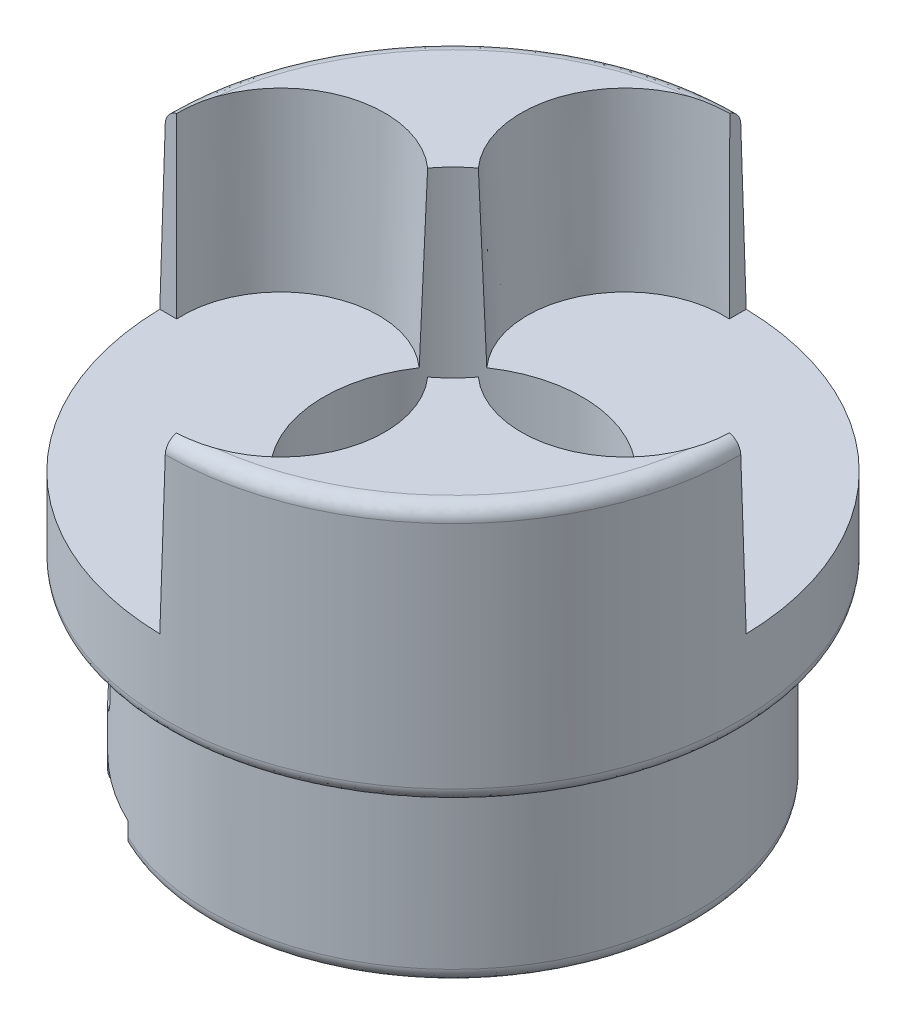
ISO-10303-21;
HEADER;
FILE_DESCRIPTION(('STEP AP214'),'2;1');
FILE_NAME('part.step','',(''),(''),'','','');
FILE_SCHEMA(('AUTOMOTIVE_DESIGN { 1 0 10303 214 1 1 1 1 }'));
ENDSEC;
DATA;
#1=APPLICATION_CONTEXT('core data for automotive mechanical design processes');
#2=APPLICATION_PROTOCOL_DEFINITION('international standard','automotive_design',2000,#1);
#3=PRODUCT_CONTEXT('',#1,'mechanical');
#4=PRODUCT('Part','Part','',(#3));
#5=PRODUCT_RELATED_PRODUCT_CATEGORY('part','',(#4));
#6=PRODUCT_DEFINITION_FORMATION('','',#4);
#7=PRODUCT_DEFINITION_CONTEXT('part definition',#1,'design');
#8=PRODUCT_DEFINITION('design','',#6,#7);
#9=PRODUCT_DEFINITION_SHAPE('','',#8);
#10=(LENGTH_UNIT() NAMED_UNIT(*) SI_UNIT(.MILLI.,.METRE.));
#11=(NAMED_UNIT(*) PLANE_ANGLE_UNIT() SI_UNIT($,.RADIAN.));
#12=(NAMED_UNIT(*) SI_UNIT($,.STERADIAN.) SOLID_ANGLE_UNIT());
#13=UNCERTAINTY_MEASURE_WITH_UNIT(LENGTH_MEASURE(1.E-05),#10,'distance_accuracy_value','');
#14=(GEOMETRIC_REPRESENTATION_CONTEXT(3) GLOBAL_UNCERTAINTY_ASSIGNED_CONTEXT((#13)) GLOBAL_UNIT_ASSIGNED_CONTEXT((#10,
#11,#12)) REPRESENTATION_CONTEXT('',''));
#15=CARTESIAN_POINT('',(0.,0.,0.));
#16=DIRECTION('',(0.,0.,1.));
#17=DIRECTION('',(1.,0.,0.));
#18=AXIS2_PLACEMENT_3D('',#15,#16,#17);
#19=CARTESIAN_POINT('',(-4.203403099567,13.,-26.539242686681));
#20=DIRECTION('',(0.,-1.,0.));
#21=DIRECTION('',(0.809016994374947,0.,0.587785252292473));
#22=AXIS2_PLACEMENT_3D('',#19,#20,#21);
#23=PLANE('',#22);
#24=CARTESIAN_POINT('',(0.,13.,0.));
#25=DIRECTION('',(0.,-1.,0.));
#26=DIRECTION('',(0.809016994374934,0.,0.587785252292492));
#27=AXIS2_PLACEMENT_3D('',#24,#25,#26);
#28=CIRCLE('',#27,18.0000000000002);
#29=CARTESIAN_POINT('',(14.562305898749,13.,10.580134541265));
#30=VERTEX_POINT('',#29);
#31=EDGE_CURVE('E356',#30,#30,#28,.F.);
#32=ORIENTED_EDGE('',*,*,#31,.T.);
#33=EDGE_LOOP('',(#32));
#34=FACE_BOUND('',#33,.T.);
#35=CARTESIAN_POINT('',(0.,13.,0.));
#36=DIRECTION('',(0.,1.,0.));
#37=DIRECTION('',(0.809016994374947,0.,0.587785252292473));
#38=AXIS2_PLACEMENT_3D('',#35,#36,#37);
#39=CIRCLE('',#38,19.);
#40=CARTESIAN_POINT('',(15.371322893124,13.,11.167919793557));
#41=VERTEX_POINT('',#40);
#42=EDGE_CURVE('E348',#41,#41,#39,.T.);
#43=ORIENTED_EDGE('',*,*,#42,.F.);
#44=EDGE_LOOP('',(#43));
#45=FACE_BOUND('',#44,.T.);
#46=ADVANCED_FACE('F16',(#34,#45),#23,.T.);
#47=CARTESIAN_POINT('',(-11.313708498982,0.,11.313708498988));
#48=DIRECTION('',(-0.707106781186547,0.,-0.707106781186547));
#49=DIRECTION('',(-0.707106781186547,0.,0.707106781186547));
#50=AXIS2_PLACEMENT_3D('',#47,#48,#49);
#51=PLANE('',#50);
#52=DIRECTION('',(-0.707106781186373,0.,0.707106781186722));
#53=VECTOR('',#52,1.);
#54=CARTESIAN_POINT('',(-13.3447181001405,2.,13.3447181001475));
#55=LINE('',#54,#53);
#56=CARTESIAN_POINT('',(-11.313708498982,2.00000000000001,11.313708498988));
#57=VERTEX_POINT('',#56);
#58=CARTESIAN_POINT('',(-12.0208152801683,2.,12.0208152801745));
#59=VERTEX_POINT('',#58);
#60=EDGE_CURVE('E709',#57,#59,#55,.T.);
#61=ORIENTED_EDGE('',*,*,#60,.T.);
#62=DIRECTION('',(0.,1.,0.));
#63=VECTOR('',#62,1.);
#64=CARTESIAN_POINT('',(-12.0208152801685,1.,12.0208152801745));
#65=LINE('',#64,#63);
#66=CARTESIAN_POINT('',(-12.0208152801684,1.,12.0208152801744));
#67=VERTEX_POINT('',#66);
#68=EDGE_CURVE('E63',#67,#59,#65,.T.);
#69=ORIENTED_EDGE('',*,*,#68,.F.);
#70=CARTESIAN_POINT('',(-11.3137084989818,0.,11.3137084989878));
#71=CARTESIAN_POINT('',(-11.3336027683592,2.00381552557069E-07,11.3336027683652));
#72=CARTESIAN_POINT('',(-11.35348749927,0.00118809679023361,11.353487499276));
#73=CARTESIAN_POINT('',(-11.3931146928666,0.00592711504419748,11.3931146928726));
#74=CARTESIAN_POINT('',(-11.4128571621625,0.00947812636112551,11.4128571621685));
#75=CARTESIAN_POINT('',(-11.4716244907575,0.023642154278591,11.4716244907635));
#76=CARTESIAN_POINT('',(-11.5102557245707,0.0377662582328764,11.5102557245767));
#77=CARTESIAN_POINT('',(-11.5852918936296,0.0749850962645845,11.5852918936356));
#78=CARTESIAN_POINT('',(-11.6216957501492,0.098084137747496,11.6216957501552));
#79=CARTESIAN_POINT('',(-11.691244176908,0.152596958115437,11.691244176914));
#80=CARTESIAN_POINT('',(-11.7243893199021,0.184009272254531,11.7243893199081));
#81=CARTESIAN_POINT('',(-11.786479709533,0.254252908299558,11.786479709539));
#82=CARTESIAN_POINT('',(-11.8154245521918,0.293084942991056,11.8154245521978));
#83=CARTESIAN_POINT('',(-11.8683022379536,0.377095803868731,11.8683022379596));
#84=CARTESIAN_POINT('',(-11.892235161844,0.422274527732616,11.8922351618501));
#85=CARTESIAN_POINT('',(-11.9238499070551,0.493789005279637,11.9238499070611));
#86=CARTESIAN_POINT('',(-11.9336803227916,0.51827309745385,11.9336803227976));
#87=CARTESIAN_POINT('',(-11.9518408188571,0.568300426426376,11.9518408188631));
#88=CARTESIAN_POINT('',(-11.9601722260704,0.593842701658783,11.9601722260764));
#89=CARTESIAN_POINT('',(-11.9828300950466,0.671820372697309,11.9828300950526));
#90=CARTESIAN_POINT('',(-11.994842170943,0.725656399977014,11.994842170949));
#91=CARTESIAN_POINT('',(-12.0093017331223,0.816509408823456,12.0093017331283));
#92=CARTESIAN_POINT('',(-12.0136165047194,0.852963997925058,12.0136165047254));
#93=CARTESIAN_POINT('',(-12.0193721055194,0.926271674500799,12.0193721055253));
#94=CARTESIAN_POINT('',(-12.0208170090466,0.963124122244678,12.0208170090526));
#95=CARTESIAN_POINT('',(-12.0208152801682,1.,12.0208152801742));
#96=B_SPLINE_CURVE_WITH_KNOTS('',3,(#70,#71,#72,#73,#74,#75,#76,#77,#78,#79,#80,#81,#82,#83,#84,
#85,#86,#87,#88,#89,#90,#91,#92,#93,#94,#95),.UNSPECIFIED.,.F.,.F.,(4,2,2,2,2,2,2,2,2,2,2,2,4),
(0.,0.0843523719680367,0.168700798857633,0.337119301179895,0.505618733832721,0.674088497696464,
0.842574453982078,1.01105769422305,1.09543727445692,1.17974179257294,1.34817695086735,
1.45885920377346,1.56938420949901),.UNSPECIFIED.);
#97=CARTESIAN_POINT('',(-11.3137084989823,0.,11.3137084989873));
#98=VERTEX_POINT('',#97);
#99=EDGE_CURVE('E602',#98,#67,#96,.T.);
#100=ORIENTED_EDGE('',*,*,#99,.F.);
#101=DIRECTION('',(0.,1.,0.));
#102=VECTOR('',#101,1.);
#103=CARTESIAN_POINT('',(-11.313708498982,2.872281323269,11.313708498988));
#104=LINE('',#103,#102);
#105=EDGE_CURVE('E330',#98,#57,#104,.T.);
#106=ORIENTED_EDGE('',*,*,#105,.T.);
#107=EDGE_LOOP('',(#61,#69,#100,#106));
#108=FACE_BOUND('',#107,.T.);
#109=ADVANCED_FACE('F372',(#108),#51,.F.);
#110=CARTESIAN_POINT('',(13.753288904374,12.,9.992349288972));
#111=CARTESIAN_POINT('',(13.753288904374,13.,9.992349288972));
#112=CARTESIAN_POINT('',(14.562305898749,13.,10.580134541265));
#113=CARTESIAN_POINT('',(15.371322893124,13.,11.167919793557));
#114=CARTESIAN_POINT('',(15.371322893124,12.,11.167919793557));
#115=(BOUNDED_CURVE() B_SPLINE_CURVE(2,(#110,#111,#112,#113,#114),.UNSPECIFIED.,.F.,
.F.) B_SPLINE_CURVE_WITH_KNOTS((3,2,3),(0.5,0.75,1.),
.UNSPECIFIED.) CURVE() GEOMETRIC_REPRESENTATION_ITEM() RATIONAL_B_SPLINE_CURVE((1.,
0.70710678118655,1.,0.70710678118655,1.)) REPRESENTATION_ITEM(''));
#116=CARTESIAN_POINT('',(0.,11.,0.));
#117=DIRECTION('',(0.,1.,0.));
#118=AXIS1_PLACEMENT('',#116,#117);
#119=SURFACE_OF_REVOLUTION('',#115,#118);
#120=CARTESIAN_POINT('',(0.,12.,0.));
#121=DIRECTION('',(0.,1.,0.));
#122=DIRECTION('',(0.,0.,1.));
#123=AXIS2_PLACEMENT_3D('',#120,#121,#122);
#124=CIRCLE('',#123,16.9999999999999);
#125=CARTESIAN_POINT('',(0.,12.,16.9999999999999));
#126=VERTEX_POINT('',#125);
#127=EDGE_CURVE('E345',#126,#126,#124,.T.);
#128=ORIENTED_EDGE('',*,*,#127,.T.);
#129=EDGE_LOOP('',(#128));
#130=FACE_BOUND('',#129,.T.);
#131=ORIENTED_EDGE('',*,*,#31,.F.);
#132=EDGE_LOOP('',(#131));
#133=FACE_BOUND('',#132,.T.);
#134=ADVANCED_FACE('F703',(#130,#133),#119,.T.);
#135=CARTESIAN_POINT('',(-11.313708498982,2.,11.313708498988));
#136=DIRECTION('',(0.,1.,0.));
#137=DIRECTION('',(-0.707106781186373,0.,0.707106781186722));
#138=AXIS2_PLACEMENT_3D('',#135,#136,#137);
#139=PLANE('',#138);
#140=CARTESIAN_POINT('',(0.,2.,0.));
#141=DIRECTION('',(0.,1.,0.));
#142=DIRECTION('',(0.,0.,1.));
#143=AXIS2_PLACEMENT_3D('',#140,#141,#142);
#144=CIRCLE('',#143,16.9999999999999);
#145=CARTESIAN_POINT('',(-7.2516892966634,2.,15.3757277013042));
#146=VERTEX_POINT('',#145);
#147=EDGE_CURVE('E344',#146,#59,#144,.F.);
#148=ORIENTED_EDGE('',*,*,#147,.T.);
#149=ORIENTED_EDGE('',*,*,#60,.F.);
#150=DIRECTION('',(0.70710678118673,0.,0.707106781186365));
#151=VECTOR('',#150,1.);
#152=CARTESIAN_POINT('',(-9.28269889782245,2.00000000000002,13.3447181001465));
#153=LINE('',#152,#151);
#154=EDGE_CURVE('E337',#57,#146,#153,.T.);
#155=ORIENTED_EDGE('',*,*,#154,.T.);
#156=EDGE_LOOP('',(#148,#149,#155));
#157=FACE_BOUND('',#156,.T.);
#158=ADVANCED_FACE('F706',(#157),#139,.F.);
#159=CARTESIAN_POINT('',(16.180339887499,14.,11.755705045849));
#160=CARTESIAN_POINT('',(16.180339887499,13.,11.755705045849));
#161=CARTESIAN_POINT('',(15.371322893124,13.,11.167919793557));
#162=CARTESIAN_POINT('',(14.562305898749,13.,10.580134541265));
#163=CARTESIAN_POINT('',(14.562305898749,14.,10.580134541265));
#164=(BOUNDED_CURVE() B_SPLINE_CURVE(2,(#159,#160,#161,#162,#163),.UNSPECIFIED.,.F.,
.F.) B_SPLINE_CURVE_WITH_KNOTS((3,2,3),(0.,0.25,0.5),
.UNSPECIFIED.) CURVE() GEOMETRIC_REPRESENTATION_ITEM() RATIONAL_B_SPLINE_CURVE((1.,
0.70710678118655,1.,0.70710678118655,1.)) REPRESENTATION_ITEM(''));
#165=CARTESIAN_POINT('',(0.,13.,0.));
#166=DIRECTION('',(0.,1.,0.));
#167=AXIS1_PLACEMENT('',#165,#166);
#168=SURFACE_OF_REVOLUTION('',#164,#167);
#169=ORIENTED_EDGE('',*,*,#42,.T.);
#170=EDGE_LOOP('',(#169));
#171=FACE_BOUND('',#170,.T.);
#172=CARTESIAN_POINT('',(0.,14.,0.));
#173=DIRECTION('',(0.,1.,0.));
#174=DIRECTION('',(0.,0.,1.));
#175=AXIS2_PLACEMENT_3D('',#172,#173,#174);
#176=CIRCLE('',#175,19.9999999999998);
#177=CARTESIAN_POINT('',(0.,14.,19.9999999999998));
#178=VERTEX_POINT('',#177);
#179=EDGE_CURVE('E175',#178,#178,#176,.F.);
#180=ORIENTED_EDGE('',*,*,#179,.T.);
#181=EDGE_LOOP('',(#180));
#182=FACE_BOUND('',#181,.T.);
#183=ADVANCED_FACE('F726',(#171,#182),#168,.F.);
#184=CARTESIAN_POINT('',(-18.818085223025,30.968528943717,0.0010989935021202));
#185=DIRECTION('',(0.,-0.0348994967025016,-0.999390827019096));
#186=DIRECTION('',(0.,-0.999390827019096,0.0348994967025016));
#187=AXIS2_PLACEMENT_3D('',#184,#185,#186);
#188=PLANE('',#187);
#189=CARTESIAN_POINT('',(-19.2489553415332,30.9700870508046,0.00104458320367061));
#190=CARTESIAN_POINT('',(-19.2251680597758,30.2890092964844,0.0248283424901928));
#191=CARTESIAN_POINT('',(-19.201264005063,29.6079356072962,0.0486119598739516));
#192=CARTESIAN_POINT('',(-19.1388239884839,27.8378296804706,0.110425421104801));
#193=CARTESIAN_POINT('',(-19.1001004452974,26.7488040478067,0.148455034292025));
#194=CARTESIAN_POINT('',(-19.022007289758,24.5707887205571,0.224513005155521));
#195=CARTESIAN_POINT('',(-18.9826376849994,23.4817990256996,0.262541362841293));
#196=CARTESIAN_POINT('',(-18.9016870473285,21.2618674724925,0.340063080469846));
#197=CARTESIAN_POINT('',(-18.8600792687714,20.1309265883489,0.379556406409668));
#198=CARTESIAN_POINT('',(-18.8180852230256,19.,0.41904923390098));
#199=B_SPLINE_CURVE_WITH_KNOTS('',3,(#189,#190,#191,#192,#193,#194,#195,#196,#197,#198),
.UNSPECIFIED.,.F.,.F.,(4,2,2,2,4),(0.,2.04572376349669,5.31685539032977,8.58794859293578,
11.9851330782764),.UNSPECIFIED.);
#200=CARTESIAN_POINT('',(-19.2489009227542,30.9685289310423,0.0010989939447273));
#201=VERTEX_POINT('',#200);
#202=CARTESIAN_POINT('',(-18.8180852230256,19.,0.41904923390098));
#203=VERTEX_POINT('',#202);
#204=EDGE_CURVE('E155',#201,#203,#199,.T.);
#205=ORIENTED_EDGE('',*,*,#204,.F.);
#206=CARTESIAN_POINT('',(-19.6923800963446,30.7215306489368,0.00972436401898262));
#207=CARTESIAN_POINT('',(-19.682373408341,30.7311327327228,0.00938905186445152));
#208=CARTESIAN_POINT('',(-19.672174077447,30.740520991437,0.00906120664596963));
#209=CARTESIAN_POINT('',(-19.6609366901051,30.7504408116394,0.00871479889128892));
#210=CARTESIAN_POINT('',(-19.6600904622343,30.7511852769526,0.00868880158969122));
#211=CARTESIAN_POINT('',(-19.6442010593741,30.7651162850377,0.00820232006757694));
#212=CARTESIAN_POINT('',(-19.6287569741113,30.7778578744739,0.00775737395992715));
#213=CARTESIAN_POINT('',(-19.6111901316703,30.7914859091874,0.00728147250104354));
#214=CARTESIAN_POINT('',(-19.6094252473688,30.7928456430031,0.00723398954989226));
#215=CARTESIAN_POINT('',(-19.5956941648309,30.8033516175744,0.00686711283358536));
#216=CARTESIAN_POINT('',(-19.5835229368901,30.8122355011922,0.00655688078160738));
#217=CARTESIAN_POINT('',(-19.568649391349,30.8225850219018,0.00619546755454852));
#218=CARTESIAN_POINT('',(-19.5661311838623,30.8243201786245,0.00613487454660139));
#219=CARTESIAN_POINT('',(-19.5518527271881,30.834062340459,0.00579467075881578));
#220=CARTESIAN_POINT('',(-19.5399271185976,30.8418314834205,0.00552336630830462));
#221=CARTESIAN_POINT('',(-19.5246179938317,30.8513457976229,0.00519111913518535));
#222=CARTESIAN_POINT('',(-19.5213816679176,30.8533316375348,0.00512177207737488));
#223=CARTESIAN_POINT('',(-19.5092857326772,30.8606592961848,0.00486588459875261));
#224=CARTESIAN_POINT('',(-19.5003534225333,30.8658827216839,0.00468347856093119));
#225=CARTESIAN_POINT('',(-19.4875851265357,30.8730858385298,0.00443194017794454));
#226=CARTESIAN_POINT('',(-19.4838137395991,30.8751813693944,0.00435876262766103));
#227=CARTESIAN_POINT('',(-19.4653838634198,30.8852661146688,0.0040065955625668));
#228=CARTESIAN_POINT('',(-19.4505349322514,30.8929146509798,0.00373950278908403));
#229=CARTESIAN_POINT('',(-19.431085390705,30.9023243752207,0.00341090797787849));
#230=CARTESIAN_POINT('',(-19.4266484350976,30.904430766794,0.0033373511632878));
#231=CARTESIAN_POINT('',(-19.4110674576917,30.9116874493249,0.00308394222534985));
#232=CARTESIAN_POINT('',(-19.3998421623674,30.9166661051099,0.00291008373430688));
#233=CARTESIAN_POINT('',(-19.3837202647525,30.9234640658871,0.00267269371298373));
#234=CARTESIAN_POINT('',(-19.3788947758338,30.9254544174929,0.00260318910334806));
#235=CARTESIAN_POINT('',(-19.362958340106,30.9318820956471,0.00237872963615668));
#236=CARTESIAN_POINT('',(-19.3517814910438,30.936158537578,0.00222939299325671));
#237=CARTESIAN_POINT('',(-19.3355084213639,30.9420523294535,0.0020235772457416));
#238=CARTESIAN_POINT('',(-19.3304700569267,30.9438315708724,0.00196144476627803));
#239=CARTESIAN_POINT('',(-19.317176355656,30.9484065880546,0.00180168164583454));
#240=CARTESIAN_POINT('',(-19.3088976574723,30.9511351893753,0.00170639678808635));
#241=CARTESIAN_POINT('',(-19.2955376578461,30.9553457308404,0.00155936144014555));
#242=CARTESIAN_POINT('',(-19.290477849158,30.9568963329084,0.00150521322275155));
#243=CARTESIAN_POINT('',(-19.2709022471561,30.9627257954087,0.00130164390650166));
#244=CARTESIAN_POINT('',(-19.2563001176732,30.9667157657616,0.00116231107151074));
#245=CARTESIAN_POINT('',(-19.2416118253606,30.9703729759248,0.00103459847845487));
#246=B_SPLINE_CURVE_WITH_KNOTS('',3,(#206,#207,#208,#209,#210,#211,#212,#213,#214,#215,#216,
#217,#218,#219,#220,#221,#222,#223,#224,#225,#226,#227,#228,#229,#230,#231,#232,#233,#234,#235,
#236,#237,#238,#239,#240,#241,#242,#243,#244,#245),.UNSPECIFIED.,.F.,.F.,(4,2,2,2,2,2,2,2,2,2,2,
2,2,2,2,2,2,2,2,4),(0.,0.0415987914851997,0.0449809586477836,0.105009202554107,
0.111694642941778,0.156888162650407,0.166064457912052,0.208753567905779,0.220146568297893,
0.251187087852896,0.264132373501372,0.314219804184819,0.328956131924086,0.365788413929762,
0.381449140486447,0.417343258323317,0.433373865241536,0.459522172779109,0.47539867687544,
0.520800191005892),.UNSPECIFIED.);
#247=CARTESIAN_POINT('',(-19.6923800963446,30.7215306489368,0.00972436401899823));
#248=VERTEX_POINT('',#247);
#249=EDGE_CURVE('E70',#248,#201,#246,.T.);
#250=ORIENTED_EDGE('',*,*,#249,.F.);
#251=DIRECTION('',(-0.720955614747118,-0.69255909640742,0.0241846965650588));
#252=VECTOR('',#251,1.);
#253=CARTESIAN_POINT('',(-19.6923794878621,30.7215303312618,0.00972437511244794));
#254=LINE('',#253,#252);
#255=CARTESIAN_POINT('',(-19.6931507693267,30.7207894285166,0.00975024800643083));
#256=VERTEX_POINT('',#255);
#257=EDGE_CURVE('E169',#256,#248,#254,.F.);
#258=ORIENTED_EDGE('',*,*,#257,.F.);
#259=CARTESIAN_POINT('',(-19.9999695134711,29.9999999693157,0.0349207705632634));
#260=CARTESIAN_POINT('',(-19.9999702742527,30.0195631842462,0.034237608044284));
#261=CARTESIAN_POINT('',(-19.9993979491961,30.0391114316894,0.0335549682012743));
#262=CARTESIAN_POINT('',(-19.9981411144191,30.0605329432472,0.0328069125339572));
#263=CARTESIAN_POINT('',(-19.9980239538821,30.0624366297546,0.0327404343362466));
#264=CARTESIAN_POINT('',(-19.9969743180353,30.0787308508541,0.0321714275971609));
#265=CARTESIAN_POINT('',(-19.995735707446,30.0931041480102,0.0316695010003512));
#266=CARTESIAN_POINT('',(-19.9938503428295,30.1105594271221,0.0310599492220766));
#267=CARTESIAN_POINT('',(-19.9934989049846,30.1136757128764,0.0309511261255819));
#268=CARTESIAN_POINT('',(-19.9915598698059,30.1301721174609,0.0303750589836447));
#269=CARTESIAN_POINT('',(-19.9897161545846,30.1435241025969,0.0299087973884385));
#270=CARTESIAN_POINT('',(-19.9869642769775,30.1608594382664,0.0293034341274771));
#271=CARTESIAN_POINT('',(-19.9863002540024,30.1648832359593,0.0291629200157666));
#272=CARTESIAN_POINT('',(-19.9839712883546,30.1784778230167,0.0286881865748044));
#273=CARTESIAN_POINT('',(-19.9821912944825,30.1880294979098,0.0283546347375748));
#274=CARTESIAN_POINT('',(-19.979355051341,30.2021069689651,0.0278630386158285));
#275=CARTESIAN_POINT('',(-19.9784057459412,30.2066548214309,0.0277042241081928));
#276=CARTESIAN_POINT('',(-19.9739933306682,30.227080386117,0.0269909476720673));
#277=CARTESIAN_POINT('',(-19.9701738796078,30.2428841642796,0.0264390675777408));
#278=CARTESIAN_POINT('',(-19.9646355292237,30.2635775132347,0.0257164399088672));
#279=CARTESIAN_POINT('',(-19.9632600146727,30.2685617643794,0.0255423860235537));
#280=CARTESIAN_POINT('',(-19.9585115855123,30.2852616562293,0.0249592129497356));
#281=CARTESIAN_POINT('',(-19.9549624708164,30.2969283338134,0.0245518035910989));
#282=CARTESIAN_POINT('',(-19.9495560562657,30.3135991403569,0.0239696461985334));
#283=CARTESIAN_POINT('',(-19.947870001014,30.3186597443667,0.0237929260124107));
#284=CARTESIAN_POINT('',(-19.9421805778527,30.3352911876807,0.0232121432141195));
#285=CARTESIAN_POINT('',(-19.9380044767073,30.3468039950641,0.0228101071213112));
#286=CARTESIAN_POINT('',(-19.9317284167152,30.3631623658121,0.0222388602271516));
#287=CARTESIAN_POINT('',(-19.9297991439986,30.3680743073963,0.0220673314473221));
#288=CARTESIAN_POINT('',(-19.9243802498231,30.3815561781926,0.0215965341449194));
#289=CARTESIAN_POINT('',(-19.9208100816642,30.3900941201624,0.0212983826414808));
#290=CARTESIAN_POINT('',(-19.9150970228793,30.4032410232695,0.0208392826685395));
#291=CARTESIAN_POINT('',(-19.913036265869,30.407886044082,0.020677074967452));
#292=CARTESIAN_POINT('',(-19.904019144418,30.4277998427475,0.0199816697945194));
#293=CARTESIAN_POINT('',(-19.8967118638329,30.4429133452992,0.0194538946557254));
#294=CARTESIAN_POINT('',(-19.8869390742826,30.4618920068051,0.0187911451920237));
#295=CARTESIAN_POINT('',(-19.8848198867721,30.4659390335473,0.0186498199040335));
#296=CARTESIAN_POINT('',(-19.8763359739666,30.4818740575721,0.0180933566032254));
#297=CARTESIAN_POINT('',(-19.8697572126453,30.4936501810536,0.0176821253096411));
#298=CARTESIAN_POINT('',(-19.8609328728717,30.5087216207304,0.0171558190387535));
#299=CARTESIAN_POINT('',(-19.8589013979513,30.5121442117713,0.017036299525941));
#300=CARTESIAN_POINT('',(-19.8495311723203,30.5277183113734,0.0164924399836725));
#301=CARTESIAN_POINT('',(-19.8419525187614,30.5397281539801,0.0160730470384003));
#302=CARTESIAN_POINT('',(-19.8323223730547,30.5542923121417,0.0155644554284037));
#303=CARTESIAN_POINT('',(-19.8305086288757,30.5570063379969,0.0154696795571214));
#304=CARTESIAN_POINT('',(-19.8221435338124,30.5693918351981,0.0150371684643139));
#305=CARTESIAN_POINT('',(-19.8154349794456,30.5789588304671,0.0147030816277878));
#306=CARTESIAN_POINT('',(-19.8070298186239,30.590509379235,0.0142997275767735));
#307=CARTESIAN_POINT('',(-19.8054897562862,30.592608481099,0.0142264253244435));
#308=CARTESIAN_POINT('',(-19.792213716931,30.6105561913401,0.0135996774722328));
#309=CARTESIAN_POINT('',(-19.7800120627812,30.6260697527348,0.0130579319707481));
#310=CARTESIAN_POINT('',(-19.7663883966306,30.642374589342,0.0124885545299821));
#311=CARTESIAN_POINT('',(-19.7654071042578,30.6435435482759,0.0124477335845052));
#312=CARTESIAN_POINT('',(-19.7535990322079,30.6575445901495,0.0119588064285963));
#313=CARTESIAN_POINT('',(-19.7424482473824,30.670110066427,0.0115200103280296));
#314=CARTESIAN_POINT('',(-19.7305862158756,30.6828173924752,0.0110762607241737));
#315=CARTESIAN_POINT('',(-19.730180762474,30.6832509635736,0.0110611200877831));
#316=CARTESIAN_POINT('',(-19.7178938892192,30.6963664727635,0.0106031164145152));
#317=CARTESIAN_POINT('',(-19.705684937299,30.7087357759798,0.0101711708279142));
#318=CARTESIAN_POINT('',(-19.6931511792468,30.7207899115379,0.00975023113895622));
#319=B_SPLINE_CURVE_WITH_KNOTS('',3,(#259,#260,#261,#262,#263,#264,#265,#266,#267,#268,#269,
#270,#271,#272,#273,#274,#275,#276,#277,#278,#279,#280,#281,#282,#283,#284,#285,#286,#287,#288,
#289,#290,#291,#292,#293,#294,#295,#296,#297,#298,#299,#300,#301,#302,#303,#304,#305,#306,#307,
#308,#309,#310,#311,#312,#313,#314,#315,#316,#317,#318),.UNSPECIFIED.,.F.,.F.,(4,2,2,2,2,2,2,2,
2,2,2,2,2,2,2,2,2,2,2,2,2,2,2,2,2,2,2,2,2,4),(0.,0.0586898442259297,0.0644151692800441,
0.107702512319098,0.117116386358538,0.157561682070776,0.169803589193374,0.198963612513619,
0.212909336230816,0.261688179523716,0.277208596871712,0.313802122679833,0.329812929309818,
0.366562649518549,0.382402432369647,0.410175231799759,0.425427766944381,0.475786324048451,
0.489497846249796,0.529969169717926,0.541914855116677,0.584519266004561,0.594316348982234,
0.62937466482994,0.637188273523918,0.696372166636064,0.700952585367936,0.751337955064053,
0.753119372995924,0.805271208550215),.UNSPECIFIED.);
#320=CARTESIAN_POINT('',(-19.999969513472,29.9999999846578,0.0349207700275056));
#321=VERTEX_POINT('',#320);
#322=EDGE_CURVE('E41',#321,#256,#319,.T.);
#323=ORIENTED_EDGE('',*,*,#322,.F.);
#324=CARTESIAN_POINT('',(0.,31.0000000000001,0.));
#325=DIRECTION('',(0.,-0.0348994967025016,-0.999390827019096));
#326=DIRECTION('',(0.,0.999390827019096,-0.0348994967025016));
#327=AXIS2_PLACEMENT_3D('',#324,#325,#326);
#328=ELLIPSE('',#327,573.07416695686,19.9999999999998);
#329=CARTESIAN_POINT('',(-19.9956094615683,19.,0.41904923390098));
#330=VERTEX_POINT('',#329);
#331=EDGE_CURVE('E178',#321,#330,#328,.F.);
#332=ORIENTED_EDGE('',*,*,#331,.T.);
#333=DIRECTION('',(-1.,0.,0.));
#334=VECTOR('',#333,1.);
#335=CARTESIAN_POINT('',(-24.805997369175,19.,0.41904923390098));
#336=LINE('',#335,#334);
#337=EDGE_CURVE('E158',#203,#330,#336,.T.);
#338=ORIENTED_EDGE('',*,*,#337,.F.);
#339=EDGE_LOOP('',(#205,#250,#258,#323,#332,#338));
#340=FACE_BOUND('',#339,.T.);
#341=ADVANCED_FACE('F156',(#340),#188,.F.);
#342=CARTESIAN_POINT('',(18.818085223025,30.968528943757,-0.0010989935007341));
#343=DIRECTION('',(0.,-0.0348994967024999,0.999390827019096));
#344=DIRECTION('',(0.,-0.999390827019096,-0.0348994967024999));
#345=AXIS2_PLACEMENT_3D('',#342,#343,#344);
#346=PLANE('',#345);
#347=CARTESIAN_POINT('',(19.2489548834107,30.9700870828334,-0.00104504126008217));
#348=CARTESIAN_POINT('',(19.2251678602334,30.2890093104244,-0.0248285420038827));
#349=CARTESIAN_POINT('',(19.2012639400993,29.6079356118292,-0.0486120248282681));
#350=CARTESIAN_POINT('',(19.1388240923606,27.8378296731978,-0.110425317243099));
#351=CARTESIAN_POINT('',(19.1001004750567,26.7488040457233,-0.148455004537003));
#352=CARTESIAN_POINT('',(19.022007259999,24.5707887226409,-0.224513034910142));
#353=CARTESIAN_POINT('',(18.9826376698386,23.4817990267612,-0.26254137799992));
#354=CARTESIAN_POINT('',(18.9016870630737,21.2618674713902,-0.340063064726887));
#355=CARTESIAN_POINT('',(18.8600793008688,20.1309265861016,-0.379556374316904));
#356=CARTESIAN_POINT('',(18.8180852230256,19.,-0.41904923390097));
#357=B_SPLINE_CURVE_WITH_KNOTS('',3,(#347,#348,#349,#350,#351,#352,#353,#354,#355,#356),
.UNSPECIFIED.,.F.,.F.,(4,2,2,2,4),(0.,2.04572376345,5.31685539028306,8.58794859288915,
11.9851330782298),.UNSPECIFIED.);
#358=CARTESIAN_POINT('',(19.2489009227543,30.9685289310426,-0.00109899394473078));
#359=VERTEX_POINT('',#358);
#360=CARTESIAN_POINT('',(18.8180852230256,19.,-0.41904923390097));
#361=VERTEX_POINT('',#360);
#362=EDGE_CURVE('E267',#359,#361,#357,.T.);
#363=ORIENTED_EDGE('',*,*,#362,.F.);
#364=CARTESIAN_POINT('',(19.6923800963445,30.7215306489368,-0.00972436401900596));
#365=CARTESIAN_POINT('',(19.6823734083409,30.7311327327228,-0.00938905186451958));
#366=CARTESIAN_POINT('',(19.6721740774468,30.7405209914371,-0.00906120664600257));
#367=CARTESIAN_POINT('',(19.6609366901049,30.7504408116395,-0.00871479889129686));
#368=CARTESIAN_POINT('',(19.6600904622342,30.7511852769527,-0.00868880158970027));
#369=CARTESIAN_POINT('',(19.644201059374,30.7651162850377,-0.00820232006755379));
#370=CARTESIAN_POINT('',(19.6287569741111,30.777857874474,-0.0077573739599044));
#371=CARTESIAN_POINT('',(19.6111901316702,30.7914859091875,-0.00728147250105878));
#372=CARTESIAN_POINT('',(19.6094252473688,30.7928456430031,-0.00723398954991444));
#373=CARTESIAN_POINT('',(19.5956941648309,30.8033516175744,-0.00686711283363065));
#374=CARTESIAN_POINT('',(19.58352293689,30.8122355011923,-0.00655688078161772));
#375=CARTESIAN_POINT('',(19.5686493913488,30.822585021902,-0.00619546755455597));
#376=CARTESIAN_POINT('',(19.5661311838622,30.8243201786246,-0.00613487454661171));
#377=CARTESIAN_POINT('',(19.551852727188,30.834062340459,-0.00579467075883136));
#378=CARTESIAN_POINT('',(19.5399271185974,30.8418314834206,-0.00552336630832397));
#379=CARTESIAN_POINT('',(19.5246179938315,30.8513457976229,-0.00519111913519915));
#380=CARTESIAN_POINT('',(19.5213816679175,30.8533316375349,-0.0051217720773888));
#381=CARTESIAN_POINT('',(19.5092857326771,30.8606592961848,-0.00486588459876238));
#382=CARTESIAN_POINT('',(19.5003534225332,30.865882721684,-0.00468347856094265));
#383=CARTESIAN_POINT('',(19.4875851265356,30.8730858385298,-0.00443194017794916));
#384=CARTESIAN_POINT('',(19.483813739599,30.8751813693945,-0.00435876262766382));
#385=CARTESIAN_POINT('',(19.4653838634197,30.8852661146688,-0.0040065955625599));
#386=CARTESIAN_POINT('',(19.4505349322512,30.8929146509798,-0.00373950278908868));
#387=CARTESIAN_POINT('',(19.4310853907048,30.9023243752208,-0.00341090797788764));
#388=CARTESIAN_POINT('',(19.4266484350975,30.904430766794,-0.00333735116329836));
#389=CARTESIAN_POINT('',(19.4110674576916,30.911687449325,-0.00308394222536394));
#390=CARTESIAN_POINT('',(19.3998421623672,30.9166661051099,-0.00291008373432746));
#391=CARTESIAN_POINT('',(19.3837202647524,30.9234640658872,-0.00267269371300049));
#392=CARTESIAN_POINT('',(19.3788947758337,30.9254544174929,-0.0026031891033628));
#393=CARTESIAN_POINT('',(19.362958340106,30.9318820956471,-0.00237872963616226));
#394=CARTESIAN_POINT('',(19.3517814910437,30.9361585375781,-0.00222939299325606));
#395=CARTESIAN_POINT('',(19.3355084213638,30.9420523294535,-0.00202357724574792));
#396=CARTESIAN_POINT('',(19.3304700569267,30.9438315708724,-0.00196144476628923));
#397=CARTESIAN_POINT('',(19.317176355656,30.9484065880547,-0.00180168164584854));
#398=CARTESIAN_POINT('',(19.3088976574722,30.9511351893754,-0.00170639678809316));
#399=CARTESIAN_POINT('',(19.295537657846,30.9553457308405,-0.00155936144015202));
#400=CARTESIAN_POINT('',(19.2904778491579,30.9568963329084,-0.00150521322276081));
#401=CARTESIAN_POINT('',(19.2709022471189,30.9627257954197,-0.00130164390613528));
#402=CARTESIAN_POINT('',(19.2563001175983,30.966715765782,-0.00116231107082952));
#403=CARTESIAN_POINT('',(19.2416118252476,30.970372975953,-0.00103459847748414));
#404=B_SPLINE_CURVE_WITH_KNOTS('',3,(#364,#365,#366,#367,#368,#369,#370,#371,#372,#373,#374,
#375,#376,#377,#378,#379,#380,#381,#382,#383,#384,#385,#386,#387,#388,#389,#390,#391,#392,#393,
#394,#395,#396,#397,#398,#399,#400,#401,#402,#403),.UNSPECIFIED.,.F.,.F.,(4,2,2,2,2,2,2,2,2,2,2,
2,2,2,2,2,2,2,2,4),(0.,0.0415987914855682,0.0449809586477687,0.105009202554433,0.11169464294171,
0.156888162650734,0.166064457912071,0.208753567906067,0.220146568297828,0.251187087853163,
0.264132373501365,0.314219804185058,0.32895613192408,0.365788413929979,0.381449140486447,
0.4173432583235,0.433373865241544,0.459522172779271,0.47539867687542,0.520800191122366),.UNSPECIFIED.);
#405=CARTESIAN_POINT('',(19.6923800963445,30.7215306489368,-0.00972436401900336));
#406=VERTEX_POINT('',#405);
#407=EDGE_CURVE('E259',#406,#359,#404,.T.);
#408=ORIENTED_EDGE('',*,*,#407,.F.);
#409=DIRECTION('',(0.720955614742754,-0.692559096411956,-0.0241846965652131));
#410=VECTOR('',#409,1.);
#411=CARTESIAN_POINT('',(19.6923794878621,30.7215303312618,-0.00972437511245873));
#412=LINE('',#411,#410);
#413=CARTESIAN_POINT('',(19.6931507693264,30.7207894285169,-0.00975024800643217));
#414=VERTEX_POINT('',#413);
#415=EDGE_CURVE('E266',#414,#406,#412,.F.);
#416=ORIENTED_EDGE('',*,*,#415,.F.);
#417=CARTESIAN_POINT('',(19.9999695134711,29.9999999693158,-0.0349207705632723));
#418=CARTESIAN_POINT('',(19.9999702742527,30.0195631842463,-0.0342376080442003));
#419=CARTESIAN_POINT('',(19.9993979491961,30.0391114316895,-0.0335549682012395));
#420=CARTESIAN_POINT('',(19.9981411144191,30.0605329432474,-0.0328069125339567));
#421=CARTESIAN_POINT('',(19.9980239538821,30.062436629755,-0.0327404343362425));
#422=CARTESIAN_POINT('',(19.9969743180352,30.0787308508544,-0.0321714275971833));
#423=CARTESIAN_POINT('',(19.9957357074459,30.0931041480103,-0.0316695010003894));
#424=CARTESIAN_POINT('',(19.9938503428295,30.1105594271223,-0.0310599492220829));
#425=CARTESIAN_POINT('',(19.9934989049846,30.1136757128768,-0.0309511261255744));
#426=CARTESIAN_POINT('',(19.9915598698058,30.1301721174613,-0.0303750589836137));
#427=CARTESIAN_POINT('',(19.9897161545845,30.1435241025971,-0.0299087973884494));
#428=CARTESIAN_POINT('',(19.9869642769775,30.1608594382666,-0.0293034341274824));
#429=CARTESIAN_POINT('',(19.9863002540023,30.1648832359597,-0.0291629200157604));
#430=CARTESIAN_POINT('',(19.9839712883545,30.1784778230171,-0.0286881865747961));
#431=CARTESIAN_POINT('',(19.9821912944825,30.1880294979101,-0.0283546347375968));
#432=CARTESIAN_POINT('',(19.9793550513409,30.2021069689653,-0.0278630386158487));
#433=CARTESIAN_POINT('',(19.9784057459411,30.2066548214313,-0.0277042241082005));
#434=CARTESIAN_POINT('',(19.9739933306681,30.2270803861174,-0.0269909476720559));
#435=CARTESIAN_POINT('',(19.9701738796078,30.2428841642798,-0.0264390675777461));
#436=CARTESIAN_POINT('',(19.9646355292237,30.2635775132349,-0.0257164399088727));
#437=CARTESIAN_POINT('',(19.9632600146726,30.2685617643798,-0.0255423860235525));
#438=CARTESIAN_POINT('',(19.9585115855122,30.2852616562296,-0.0249592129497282));
#439=CARTESIAN_POINT('',(19.9549624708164,30.2969283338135,-0.024551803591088));
#440=CARTESIAN_POINT('',(19.9495560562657,30.3135991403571,-0.0239696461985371));
#441=CARTESIAN_POINT('',(19.9478700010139,30.318659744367,-0.0237929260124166));
#442=CARTESIAN_POINT('',(19.9421805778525,30.335291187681,-0.0232121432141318));
#443=CARTESIAN_POINT('',(19.9380044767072,30.3468039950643,-0.0228101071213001));
#444=CARTESIAN_POINT('',(19.9317284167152,30.3631623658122,-0.0222388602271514));
#445=CARTESIAN_POINT('',(19.9297991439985,30.3680743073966,-0.022067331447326));
#446=CARTESIAN_POINT('',(19.924380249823,30.3815561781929,-0.0215965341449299));
#447=CARTESIAN_POINT('',(19.9208100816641,30.3900941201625,-0.0212983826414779));
#448=CARTESIAN_POINT('',(19.9150970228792,30.4032410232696,-0.0208392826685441));
#449=CARTESIAN_POINT('',(19.9130362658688,30.4078860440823,-0.0206770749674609));
#450=CARTESIAN_POINT('',(19.9040191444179,30.4277998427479,-0.0199816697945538));
#451=CARTESIAN_POINT('',(19.8967118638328,30.4429133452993,-0.0194538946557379));
#452=CARTESIAN_POINT('',(19.8869390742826,30.4618920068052,-0.0187911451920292));
#453=CARTESIAN_POINT('',(19.8848198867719,30.4659390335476,-0.0186498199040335));
#454=CARTESIAN_POINT('',(19.8763359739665,30.4818740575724,-0.0180933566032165));
#455=CARTESIAN_POINT('',(19.8697572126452,30.4936501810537,-0.0176821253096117));
#456=CARTESIAN_POINT('',(19.8609328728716,30.5087216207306,-0.0171558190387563));
#457=CARTESIAN_POINT('',(19.8589013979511,30.5121442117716,-0.0170362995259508));
#458=CARTESIAN_POINT('',(19.8495311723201,30.5277183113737,-0.0164924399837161));
#459=CARTESIAN_POINT('',(19.8419525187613,30.5397281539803,-0.0160730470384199));
#460=CARTESIAN_POINT('',(19.8323223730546,30.5542923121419,-0.0155644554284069));
#461=CARTESIAN_POINT('',(19.8305086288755,30.5570063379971,-0.0154696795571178));
#462=CARTESIAN_POINT('',(19.8221435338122,30.5693918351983,-0.0150371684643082));
#463=CARTESIAN_POINT('',(19.8154349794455,30.5789588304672,-0.0147030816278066));
#464=CARTESIAN_POINT('',(19.8070298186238,30.5905093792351,-0.0142997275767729));
#465=CARTESIAN_POINT('',(19.8054897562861,30.5926084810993,-0.0142264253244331));
#466=CARTESIAN_POINT('',(19.7922137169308,30.6105561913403,-0.013599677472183));
#467=CARTESIAN_POINT('',(19.7800120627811,30.6260697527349,-0.0130579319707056));
#468=CARTESIAN_POINT('',(19.7663883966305,30.6423745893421,-0.0124885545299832));
#469=CARTESIAN_POINT('',(19.7654071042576,30.6435435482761,-0.0124477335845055));
#470=CARTESIAN_POINT('',(19.7535990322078,30.6575445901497,-0.0119588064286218));
#471=CARTESIAN_POINT('',(19.7424482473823,30.6701100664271,-0.0115200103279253));
#472=CARTESIAN_POINT('',(19.7305862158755,30.6828173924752,-0.0110762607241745));
#473=CARTESIAN_POINT('',(19.7301807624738,30.6832509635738,-0.0110611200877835));
#474=CARTESIAN_POINT('',(19.7178938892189,30.6963664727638,-0.0106031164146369));
#475=CARTESIAN_POINT('',(19.7056849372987,30.7087357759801,-0.0101711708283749));
#476=CARTESIAN_POINT('',(19.6931511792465,30.7207899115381,-0.00975023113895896));
#477=B_SPLINE_CURVE_WITH_KNOTS('',3,(#417,#418,#419,#420,#421,#422,#423,#424,#425,#426,#427,
#428,#429,#430,#431,#432,#433,#434,#435,#436,#437,#438,#439,#440,#441,#442,#443,#444,#445,#446,
#447,#448,#449,#450,#451,#452,#453,#454,#455,#456,#457,#458,#459,#460,#461,#462,#463,#464,#465,
#466,#467,#468,#469,#470,#471,#472,#473,#474,#475,#476),.UNSPECIFIED.,.F.,.F.,(4,2,2,2,2,2,2,2,
2,2,2,2,2,2,2,2,2,2,2,2,2,2,2,2,2,2,2,2,2,4),(0.,0.0586898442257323,0.0644151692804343,
0.107702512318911,0.117116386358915,0.157561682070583,0.169803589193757,0.198963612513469,
0.212909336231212,0.261688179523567,0.277208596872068,0.313802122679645,0.32981292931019,
0.366562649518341,0.382402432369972,0.410175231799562,0.425427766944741,0.475786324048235,
0.489497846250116,0.529969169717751,0.541914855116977,0.584519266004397,0.594316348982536,
0.62937466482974,0.6371882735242,0.696372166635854,0.700952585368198,0.751337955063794,
0.753119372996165,0.805271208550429),.UNSPECIFIED.);
#478=CARTESIAN_POINT('',(19.9999695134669,29.9999999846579,-0.0349207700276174));
#479=VERTEX_POINT('',#478);
#480=EDGE_CURVE('E251',#479,#414,#477,.T.);
#481=ORIENTED_EDGE('',*,*,#480,.F.);
#482=CARTESIAN_POINT('',(0.,31.0000000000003,0.));
#483=DIRECTION('',(0.,-0.0348994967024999,0.999390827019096));
#484=DIRECTION('',(0.,0.999390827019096,0.0348994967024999));
#485=AXIS2_PLACEMENT_3D('',#482,#483,#484);
#486=ELLIPSE('',#485,573.074166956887,19.9999999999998);
#487=CARTESIAN_POINT('',(19.9956094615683,19.,-0.41904923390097));
#488=VERTEX_POINT('',#487);
#489=EDGE_CURVE('E582',#479,#488,#486,.F.);
#490=ORIENTED_EDGE('',*,*,#489,.T.);
#491=DIRECTION('',(1.,0.,0.));
#492=VECTOR('',#491,1.);
#493=CARTESIAN_POINT('',(24.805997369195,19.,-0.41904923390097));
#494=LINE('',#493,#492);
#495=EDGE_CURVE('E338',#361,#488,#494,.T.);
#496=ORIENTED_EDGE('',*,*,#495,.F.);
#497=EDGE_LOOP('',(#363,#408,#416,#481,#490,#496));
#498=FACE_BOUND('',#497,.T.);
#499=ADVANCED_FACE('F272',(#498),#346,.F.);
#500=CARTESIAN_POINT('',(-11.313708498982,0.,11.313708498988));
#501=DIRECTION('',(0.707106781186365,0.,-0.70710678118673));
#502=DIRECTION('',(0.,1.,0.));
#503=AXIS2_PLACEMENT_3D('',#500,#501,#502);
#504=PLANE('',#503);
#505=ORIENTED_EDGE('',*,*,#105,.F.);
#506=CARTESIAN_POINT('',(-7.25168929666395,1.,15.375727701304));
#507=CARTESIAN_POINT('',(-7.25168936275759,0.987726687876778,15.3757276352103));
#508=CARTESIAN_POINT('',(-7.2521628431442,0.975484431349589,15.3752541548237));
#509=CARTESIAN_POINT('',(-7.25319327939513,0.962075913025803,15.3742237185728));
#510=CARTESIAN_POINT('',(-7.25329269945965,0.960844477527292,15.3741242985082));
#511=CARTESIAN_POINT('',(-7.25414792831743,0.950737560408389,15.3732690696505));
#512=CARTESIAN_POINT('',(-7.25514461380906,0.941898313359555,15.3722723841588));
#513=CARTESIAN_POINT('',(-7.25666268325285,0.931083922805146,15.370754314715));
#514=CARTESIAN_POINT('',(-7.25696263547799,0.92904181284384,15.3704543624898));
#515=CARTESIAN_POINT('',(-7.25871992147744,0.917583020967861,15.3686970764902));
#516=CARTESIAN_POINT('',(-7.26043486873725,0.908241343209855,15.3669821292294));
#517=CARTESIAN_POINT('',(-7.26419103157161,0.890597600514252,15.3632259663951));
#518=CARTESIAN_POINT('',(-7.26618970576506,0.882276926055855,15.3612272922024));
#519=CARTESIAN_POINT('',(-7.273270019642,0.855726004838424,15.3541469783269));
#520=CARTESIAN_POINT('',(-7.27911991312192,0.837895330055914,15.3482970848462));
#521=CARTESIAN_POINT('',(-7.29119265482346,0.806474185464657,15.3362243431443));
#522=CARTESIAN_POINT('',(-7.29717006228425,0.792688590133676,15.3302469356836));
#523=CARTESIAN_POINT('',(-7.31052245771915,0.764808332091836,15.3168945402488));
#524=CARTESIAN_POINT('',(-7.31797285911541,0.750785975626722,15.3094441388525));
#525=CARTESIAN_POINT('',(-7.33226825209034,0.726107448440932,15.2951487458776));
#526=CARTESIAN_POINT('',(-7.33898295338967,0.715297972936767,15.2884340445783));
#527=CARTESIAN_POINT('',(-7.35571546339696,0.689953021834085,15.271701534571));
#528=CARTESIAN_POINT('',(-7.36595644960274,0.675712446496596,15.2614605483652));
#529=CARTESIAN_POINT('',(-7.39327229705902,0.640354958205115,15.234144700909));
#530=CARTESIAN_POINT('',(-7.41086535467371,0.620041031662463,15.2165516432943));
#531=CARTESIAN_POINT('',(-7.44118335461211,0.588059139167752,15.1862336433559));
#532=CARTESIAN_POINT('',(-7.45358489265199,0.575760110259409,15.173832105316));
#533=CARTESIAN_POINT('',(-7.49128914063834,0.54032769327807,15.1361278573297));
#534=CARTESIAN_POINT('',(-7.51721653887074,0.518514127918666,15.1102004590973));
#535=CARTESIAN_POINT('',(-7.56529721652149,0.481471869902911,15.0621197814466));
#536=CARTESIAN_POINT('',(-7.5872731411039,0.465768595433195,15.0401438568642));
#537=CARTESIAN_POINT('',(-7.63171712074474,0.436003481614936,14.9956998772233));
#538=CARTESIAN_POINT('',(-7.65418403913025,0.421938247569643,14.9732329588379));
#539=CARTESIAN_POINT('',(-7.69537293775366,0.397635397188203,14.9320440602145));
#540=CARTESIAN_POINT('',(-7.71402809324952,0.387168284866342,14.9133889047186));
#541=CARTESIAN_POINT('',(-7.76790254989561,0.358290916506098,14.8595144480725));
#542=CARTESIAN_POINT('',(-7.80339718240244,0.340902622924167,14.8240198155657));
#543=CARTESIAN_POINT('',(-7.86834738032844,0.31145412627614,14.7590696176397));
#544=CARTESIAN_POINT('',(-7.89771591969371,0.299001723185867,14.7297010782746));
#545=CARTESIAN_POINT('',(-7.95666485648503,0.275477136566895,14.6707521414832));
#546=CARTESIAN_POINT('',(-7.98624471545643,0.26440225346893,14.6411722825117));
#547=CARTESIAN_POINT('',(-8.04017741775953,0.245354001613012,14.5872395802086));
#548=CARTESIAN_POINT('',(-8.06449592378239,0.237183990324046,14.5629210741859));
#549=CARTESIAN_POINT('',(-8.1319187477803,0.215568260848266,14.4954982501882));
#550=CARTESIAN_POINT('',(-8.175144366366,0.202874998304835,14.4522726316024));
#551=CARTESIAN_POINT('',(-8.25407451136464,0.18146503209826,14.3733424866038));
#552=CARTESIAN_POINT('',(-8.28973845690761,0.172443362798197,14.3376785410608));
#553=CARTESIAN_POINT('',(-8.36117446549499,0.155511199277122,14.2662425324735));
#554=CARTESIAN_POINT('',(-8.39694644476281,0.147599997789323,14.2304705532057));
#555=CARTESIAN_POINT('',(-8.461876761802,0.13414442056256,14.1655402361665));
#556=CARTESIAN_POINT('',(-8.49101813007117,0.128434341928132,14.1363988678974));
#557=CARTESIAN_POINT('',(-8.56929773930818,0.113893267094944,14.0581192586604));
#558=CARTESIAN_POINT('',(-8.61848600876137,0.105597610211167,14.0089309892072));
#559=CARTESIAN_POINT('',(-8.70793506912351,0.0918090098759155,13.9194819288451));
#560=CARTESIAN_POINT('',(-8.74817811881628,0.0860810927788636,13.8792388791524));
#561=CARTESIAN_POINT('',(-8.82865176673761,0.075462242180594,13.7987652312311));
#562=CARTESIAN_POINT('',(-8.86888227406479,0.0705699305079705,13.758534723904));
#563=CARTESIAN_POINT('',(-8.94202178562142,0.062342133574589,13.6853952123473));
#564=CARTESIAN_POINT('',(-8.97492409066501,0.0588855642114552,13.6524929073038));
#565=CARTESIAN_POINT('',(-9.11179691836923,0.0454179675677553,13.5156200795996));
#566=CARTESIAN_POINT('',(-9.21586565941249,0.0373645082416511,13.4115513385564));
#567=CARTESIAN_POINT('',(-9.36246656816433,0.0282143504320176,13.2649504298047));
#568=CARTESIAN_POINT('',(-9.40496385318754,0.0258213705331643,13.2224531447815));
#569=CARTESIAN_POINT('',(-9.48996954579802,0.021488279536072,13.137447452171));
#570=CARTESIAN_POINT('',(-9.53247795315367,0.0195481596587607,13.0949390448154));
#571=CARTESIAN_POINT('',(-9.69281115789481,0.0129590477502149,12.9346058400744));
#572=CARTESIAN_POINT('',(-9.81066212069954,0.00959959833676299,12.8167548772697));
#573=CARTESIAN_POINT('',(-10.0463839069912,0.00472600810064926,12.5810330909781));
#574=CARTESIAN_POINT('',(-10.1642547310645,0.00321193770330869,12.4631622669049));
#575=CARTESIAN_POINT('',(-10.4000112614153,0.00119811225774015,12.2274057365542));
#576=CARTESIAN_POINT('',(-10.517896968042,0.000698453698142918,12.1095200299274));
#577=CARTESIAN_POINT('',(-10.7536668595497,0.000125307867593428,11.8737501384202));
#578=CARTESIAN_POINT('',(-10.8715510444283,5.18145157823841E-05,11.755865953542));
#579=CARTESIAN_POINT('',(-11.0434827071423,7.72893567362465E-06,11.5839342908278));
#580=CARTESIAN_POINT('',(-11.0975301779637,2.96515378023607E-06,11.5298868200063));
#581=CARTESIAN_POINT('',(-11.2056212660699,-2.66190877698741E-07,11.4217957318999));
#582=CARTESIAN_POINT('',(-11.2596648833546,1.26579744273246E-06,11.3677521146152));
#583=CARTESIAN_POINT('',(-11.3137084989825,0.,11.3137084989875));
#584=B_SPLINE_CURVE_WITH_KNOTS('',3,(#506,#507,#508,#509,#510,#511,#512,#513,#514,#515,#516,
#517,#518,#519,#520,#521,#522,#523,#524,#525,#526,#527,#528,#529,#530,#531,#532,#533,#534,#535,
#536,#537,#538,#539,#540,#541,#542,#543,#544,#545,#546,#547,#548,#549,#550,#551,#552,#553,#554,
#555,#556,#557,#558,#559,#560,#561,#562,#563,#564,#565,#566,#567,#568,#569,#570,#571,#572,#573,
#574,#575,#576,#577,#578,#579,#580,#581,#582,#583),.UNSPECIFIED.,.F.,.F.,(4,2,2,2,2,2,2,2,2,2,2,
2,2,2,2,2,2,2,2,2,2,2,2,2,2,2,2,2,2,2,2,2,2,2,2,2,2,2,4),(0.,0.0367460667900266,
0.0404643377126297,0.0672811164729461,0.0735383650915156,0.102455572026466,0.128802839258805,
0.187557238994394,0.236004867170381,0.288546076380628,0.331683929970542,0.392554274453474,
0.488734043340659,0.552975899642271,0.680777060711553,0.785196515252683,0.889395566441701,
0.974531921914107,1.13381923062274,1.2638770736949,1.393675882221,1.49971499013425,
1.68697776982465,1.840676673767,1.99427723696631,2.11909083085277,2.32923838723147,
2.50083184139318,2.6721394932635,2.81211509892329,3.2542411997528,3.43468466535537,
3.61512463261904,4.11520540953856,4.61530527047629,5.11545269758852,5.61559298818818,
5.84489698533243,6.07418463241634),.UNSPECIFIED.);
#585=CARTESIAN_POINT('',(-7.2516892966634,1.,15.3757277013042));
#586=VERTEX_POINT('',#585);
#587=EDGE_CURVE('E294',#586,#98,#584,.T.);
#588=ORIENTED_EDGE('',*,*,#587,.F.);
#589=DIRECTION('',(0.,1.,0.));
#590=VECTOR('',#589,1.);
#591=CARTESIAN_POINT('',(-7.25168929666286,6.5,15.3757277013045));
#592=LINE('',#591,#590);
#593=EDGE_CURVE('E341',#586,#146,#592,.T.);
#594=ORIENTED_EDGE('',*,*,#593,.T.);
#595=ORIENTED_EDGE('',*,*,#154,.F.);
#596=EDGE_LOOP('',(#505,#588,#594,#595));
#597=FACE_BOUND('',#596,.T.);
#598=ADVANCED_FACE('F277',(#597),#504,.F.);
#599=CARTESIAN_POINT('',(0.,1.,0.));
#600=DIRECTION('',(0.,1.,0.));
#601=DIRECTION('',(0.,0.,1.));
#602=AXIS2_PLACEMENT_3D('',#599,#600,#601);
#603=CYLINDRICAL_SURFACE('',#602,16.9999999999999);
#604=ORIENTED_EDGE('',*,*,#593,.F.);
#605=CARTESIAN_POINT('',(0.,1.,0.));
#606=DIRECTION('',(0.,1.,0.));
#607=DIRECTION('',(0.,0.,1.));
#608=AXIS2_PLACEMENT_3D('',#605,#606,#607);
#609=CIRCLE('',#608,16.9999999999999);
#610=EDGE_CURVE('E544',#67,#586,#609,.F.);
#611=ORIENTED_EDGE('',*,*,#610,.F.);
#612=ORIENTED_EDGE('',*,*,#68,.T.);
#613=ORIENTED_EDGE('',*,*,#147,.F.);
#614=EDGE_LOOP('',(#604,#611,#612,#613));
#615=FACE_BOUND('',#614,.T.);
#616=CARTESIAN_POINT('',(-12.2039845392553,8.98289071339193,11.8348114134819));
#617=CARTESIAN_POINT('',(-12.2642342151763,8.97149854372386,11.7726823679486));
#618=CARTESIAN_POINT('',(-12.3234867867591,8.95443453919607,11.710626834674));
#619=CARTESIAN_POINT('',(-12.4390673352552,8.90926072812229,11.5877832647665));
#620=CARTESIAN_POINT('',(-12.4953942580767,8.88114697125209,11.5269956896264));
#621=CARTESIAN_POINT('',(-12.6042748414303,8.81435630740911,11.4078383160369));
#622=CARTESIAN_POINT('',(-12.6568268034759,8.77567468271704,11.3494696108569));
#623=CARTESIAN_POINT('',(-12.7574061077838,8.68841013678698,11.2362950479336));
#624=CARTESIAN_POINT('',(-12.805431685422,8.63982337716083,11.181490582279));
#625=CARTESIAN_POINT('',(-12.8963088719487,8.53357821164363,11.07655362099));
#626=CARTESIAN_POINT('',(-12.9391593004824,8.47591774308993,11.0264221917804));
#627=CARTESIAN_POINT('',(-13.0191378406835,8.35250932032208,10.9318748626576));
#628=CARTESIAN_POINT('',(-13.0562659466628,8.28676135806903,10.8874589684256));
#629=CARTESIAN_POINT('',(-13.1243500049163,8.14830001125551,10.8052897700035));
#630=CARTESIAN_POINT('',(-13.1553073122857,8.07558816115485,10.7675350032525));
#631=CARTESIAN_POINT('',(-13.2106930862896,7.92444137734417,10.6995100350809));
#632=CARTESIAN_POINT('',(-13.2351240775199,7.84600867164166,10.6692369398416));
#633=CARTESIAN_POINT('',(-13.2771919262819,7.68474803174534,10.6168406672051));
#634=CARTESIAN_POINT('',(-13.2948307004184,7.60192134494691,10.5947151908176));
#635=CARTESIAN_POINT('',(-13.32311620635,7.43333726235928,10.5591235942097));
#636=CARTESIAN_POINT('',(-13.3337684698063,7.34758224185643,10.5456506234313));
#637=CARTESIAN_POINT('',(-13.3479856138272,7.17455158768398,10.5276498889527));
#638=CARTESIAN_POINT('',(-13.3515499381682,7.08727583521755,10.5231228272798));
#639=CARTESIAN_POINT('',(-13.3515499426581,6.91272433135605,10.5231228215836));
#640=CARTESIAN_POINT('',(-13.3479856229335,6.82544857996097,10.5276498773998));
#641=CARTESIAN_POINT('',(-13.3337684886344,6.65241793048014,10.5456505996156));
#642=CARTESIAN_POINT('',(-13.3231162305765,6.56666291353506,10.559123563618));
#643=CARTESIAN_POINT('',(-13.2948307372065,6.39807884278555,10.5947151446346));
#644=CARTESIAN_POINT('',(-13.2771919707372,6.31525216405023,10.6168406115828));
#645=CARTESIAN_POINT('',(-13.2351241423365,6.15399155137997,10.6692368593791));
#646=CARTESIAN_POINT('',(-13.210693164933,6.07555886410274,10.699509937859));
#647=CARTESIAN_POINT('',(-13.1553074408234,5.92441216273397,10.7675348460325));
#648=CARTESIAN_POINT('',(-13.1243501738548,5.85170037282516,10.805289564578));
#649=CARTESIAN_POINT('',(-13.0562661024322,5.71323891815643,10.8874587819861));
#650=CARTESIAN_POINT('',(-13.0191379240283,5.6474908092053,10.9318747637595));
#651=CARTESIAN_POINT('',(-12.9391593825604,5.5240823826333,11.0264220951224));
#652=CARTESIAN_POINT('',(-12.8963090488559,5.46642202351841,11.0765534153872));
#653=CARTESIAN_POINT('',(-12.8054319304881,5.36017688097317,11.1814903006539));
#654=CARTESIAN_POINT('',(-12.7574063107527,5.3115900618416,11.2362948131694));
#655=CARTESIAN_POINT('',(-12.6568269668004,5.22432543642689,11.3494694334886));
#656=CARTESIAN_POINT('',(-12.6042750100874,5.18564378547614,11.4078381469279));
#657=CARTESIAN_POINT('',(-12.4953853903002,5.11884759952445,11.5270053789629));
#658=CARTESIAN_POINT('',(-12.439048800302,5.0907300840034,11.5878032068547));
#659=CARTESIAN_POINT('',(-12.3234723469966,5.04556187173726,11.7106418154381));
#660=CARTESIAN_POINT('',(-12.26423476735,5.02850261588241,11.77268159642));
#661=CARTESIAN_POINT('',(-12.1437626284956,5.00572134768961,11.8969119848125));
#662=CARTESIAN_POINT('',(-12.0825279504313,5.00000001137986,11.9591026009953));
#663=CARTESIAN_POINT('',(-11.9591081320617,4.99999999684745,12.0825224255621));
#664=CARTESIAN_POINT('',(-11.8969230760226,5.0057203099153,12.1437517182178));
#665=CARTESIAN_POINT('',(-11.7726824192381,5.02850144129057,12.2642341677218));
#666=CARTESIAN_POINT('',(-11.7106268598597,5.0455654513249,12.3234867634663));
#667=CARTESIAN_POINT('',(-11.5877832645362,5.09073927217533,12.4390673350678));
#668=CARTESIAN_POINT('',(-11.5269956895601,5.11885302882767,12.4953942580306));
#669=CARTESIAN_POINT('',(-11.4078383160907,5.18564369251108,12.6042748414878));
#670=CARTESIAN_POINT('',(-11.3494696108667,5.22432531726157,12.6568268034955));
#671=CARTESIAN_POINT('',(-11.2362950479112,5.3115898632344,12.7574061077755));
#672=CARTESIAN_POINT('',(-11.1814905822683,5.36017662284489,12.8054316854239));
#673=CARTESIAN_POINT('',(-11.0765536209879,5.46642178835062,12.8963088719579));
#674=CARTESIAN_POINT('',(-11.0264221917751,5.52408225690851,12.9391593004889));
#675=CARTESIAN_POINT('',(-10.9318748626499,5.64749067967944,13.019137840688));
#676=CARTESIAN_POINT('',(-10.8874589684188,5.71323864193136,13.056265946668));
#677=CARTESIAN_POINT('',(-10.8052897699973,5.85169998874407,13.1243500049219));
#678=CARTESIAN_POINT('',(-10.767535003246,5.92441183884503,13.1553073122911));
#679=CARTESIAN_POINT('',(-10.6995100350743,6.07555862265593,13.2106930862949));
#680=CARTESIAN_POINT('',(-10.669236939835,6.15399132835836,13.2351240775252));
#681=CARTESIAN_POINT('',(-10.6168406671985,6.31525196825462,13.2771919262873));
#682=CARTESIAN_POINT('',(-10.594715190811,6.39807865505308,13.2948307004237));
#683=CARTESIAN_POINT('',(-10.5591235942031,6.56666273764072,13.3231162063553));
#684=CARTESIAN_POINT('',(-10.5456506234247,6.65241775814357,13.3337684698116));
#685=CARTESIAN_POINT('',(-10.527649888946,6.82544841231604,13.3479856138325));
#686=CARTESIAN_POINT('',(-10.5231228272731,6.9127241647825,13.3515499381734));
#687=CARTESIAN_POINT('',(-10.5231228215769,7.08727566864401,13.3515499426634));
#688=CARTESIAN_POINT('',(-10.5276498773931,7.17455142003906,13.3479856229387));
#689=CARTESIAN_POINT('',(-10.5456505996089,7.34758206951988,13.3337684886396));
#690=CARTESIAN_POINT('',(-10.5591235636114,7.43333708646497,13.3231162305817));
#691=CARTESIAN_POINT('',(-10.594715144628,7.60192115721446,13.2948307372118));
#692=CARTESIAN_POINT('',(-10.6168406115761,7.68474783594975,13.2771919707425));
#693=CARTESIAN_POINT('',(-10.6692368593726,7.84600844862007,13.2351241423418));
#694=CARTESIAN_POINT('',(-10.6995099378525,7.92444113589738,13.2106931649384));
#695=CARTESIAN_POINT('',(-10.7675348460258,8.07558783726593,13.1553074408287));
#696=CARTESIAN_POINT('',(-10.8052895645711,8.14829962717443,13.12435017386));
#697=CARTESIAN_POINT('',(-10.8874587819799,8.28676108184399,13.0562661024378));
#698=CARTESIAN_POINT('',(-10.9318747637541,8.35250919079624,13.0191379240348));
#699=CARTESIAN_POINT('',(-11.0264220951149,8.47591761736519,12.9391593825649));
#700=CARTESIAN_POINT('',(-11.0765534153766,8.53357797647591,12.8963090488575));
#701=CARTESIAN_POINT('',(-11.1814903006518,8.63982311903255,12.8054319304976));
#702=CARTESIAN_POINT('',(-11.2362948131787,8.6884099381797,12.7574063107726));
#703=CARTESIAN_POINT('',(-11.3494694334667,8.77567456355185,12.6568269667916));
#704=CARTESIAN_POINT('',(-11.4078381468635,8.81435621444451,12.6042750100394));
#705=CARTESIAN_POINT('',(-11.5270053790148,8.88115240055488,12.4953853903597));
#706=CARTESIAN_POINT('',(-11.5878032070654,8.90926991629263,12.4390488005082));
#707=CARTESIAN_POINT('',(-11.7106418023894,8.95443812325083,12.3234723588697));
#708=CARTESIAN_POINT('',(-11.7726815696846,8.97149737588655,12.2642347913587));
#709=CARTESIAN_POINT('',(-11.8969119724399,8.99427865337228,12.1437626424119));
#710=CARTESIAN_POINT('',(-11.9591026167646,8.99999999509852,12.0825279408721));
#711=CARTESIAN_POINT('',(-12.0825224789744,9.00000000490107,11.9591080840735));
#712=CARTESIAN_POINT('',(-12.1437517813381,8.99427968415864,11.8969230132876));
#713=CARTESIAN_POINT('',(-12.2039845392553,8.98289071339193,11.8348114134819));
#714=B_SPLINE_CURVE_WITH_KNOTS('',3,(#616,#617,#618,#619,#620,#621,#622,#623,#624,#625,#626,
#627,#628,#629,#630,#631,#632,#633,#634,#635,#636,#637,#638,#639,#640,#641,#642,#643,#644,#645,
#646,#647,#648,#649,#650,#651,#652,#653,#654,#655,#656,#657,#658,#659,#660,#661,#662,#663,#664,
#665,#666,#667,#668,#669,#670,#671,#672,#673,#674,#675,#676,#677,#678,#679,#680,#681,#682,#683,
#684,#685,#686,#687,#688,#689,#690,#691,#692,#693,#694,#695,#696,#697,#698,#699,#700,#701,#702,
#703,#704,#705,#706,#707,#708,#709,#710,#711,#712,#713),.UNSPECIFIED.,.T.,.F.,(4,2,2,2,2,2,2,2,
2,2,2,2,2,2,2,2,2,2,2,2,2,2,2,2,2,2,2,2,2,2,2,2,2,2,2,2,2,2,2,2,2,2,2,2,2,2,2,2,4),(0.,
0.261686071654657,0.523465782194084,0.785362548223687,1.0473609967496,1.30941908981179,
1.57147744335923,1.83347818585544,2.09537743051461,2.35720271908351,2.61882045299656,
2.88045871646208,3.14209697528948,3.40371469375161,3.66553994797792,3.92743911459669,
4.18943960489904,4.45149850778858,4.71355606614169,4.97555475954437,5.23745160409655,
5.49927450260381,5.76089450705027,6.02253011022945,6.28414264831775,6.54582882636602,
6.80760853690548,7.06950530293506,7.33150375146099,7.59356184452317,7.85562019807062,
8.11762094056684,8.37952018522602,8.64134547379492,8.90296320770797,9.16460147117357,
9.42623973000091,9.68785744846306,9.94968270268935,10.2115818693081,10.4735823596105,
10.7356412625,10.9976988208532,11.2596975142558,11.521594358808,11.7834172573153,
12.0450372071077,12.3066729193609,12.5682855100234),.UNSPECIFIED.);
#715=CARTESIAN_POINT('',(-12.2039845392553,8.98289071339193,11.8348114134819));
#716=VERTEX_POINT('',#715);
#717=EDGE_CURVE('E591',#716,#716,#714,.T.);
#718=ORIENTED_EDGE('',*,*,#717,.F.);
#719=EDGE_LOOP('',(#718));
#720=FACE_BOUND('',#719,.T.);
#721=ORIENTED_EDGE('',*,*,#127,.F.);
#722=EDGE_LOOP('',(#721));
#723=FACE_BOUND('',#722,.T.);
#724=ADVANCED_FACE('F204',(#615,#720,#723),#603,.T.);
#725=CARTESIAN_POINT('',(0.0010989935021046,30.968528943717,-19.999969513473));
#726=DIRECTION('',(-0.999390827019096,-0.0348994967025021,0.));
#727=DIRECTION('',(0.0348994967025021,-0.999390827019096,0.));
#728=AXIS2_PLACEMENT_3D('',#725,#726,#727);
#729=PLANE('',#728);
#730=CARTESIAN_POINT('',(0.,30.9999999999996,0.));
#731=DIRECTION('',(-0.999390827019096,-0.0348994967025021,0.));
#732=DIRECTION('',(-0.0348994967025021,0.999390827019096,0.));
#733=AXIS2_PLACEMENT_3D('',#730,#731,#732);
#734=ELLIPSE('',#733,573.074166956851,19.9999999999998);
#735=CARTESIAN_POINT('',(0.41904923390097,19.,-19.9956094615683));
#736=VERTEX_POINT('',#735);
#737=CARTESIAN_POINT('',(0.0349207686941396,30.0000000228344,-19.999969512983));
#738=VERTEX_POINT('',#737);
#739=EDGE_CURVE('E580',#736,#738,#734,.F.);
#740=ORIENTED_EDGE('',*,*,#739,.T.);
#741=CARTESIAN_POINT('',(0.00131673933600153,30.9622935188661,-19.2720131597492));
#742=CARTESIAN_POINT('',(0.00156077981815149,30.9553051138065,-19.2967352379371));
#743=CARTESIAN_POINT('',(0.00183789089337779,30.94736969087,-19.3211690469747));
#744=CARTESIAN_POINT('',(0.00221149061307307,30.936671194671,-19.3502502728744));
#745=CARTESIAN_POINT('',(0.00227697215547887,30.9347960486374,-19.3552246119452));
#746=CARTESIAN_POINT('',(0.0024958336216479,30.9285286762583,-19.3714571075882));
#747=CARTESIAN_POINT('',(0.00265497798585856,30.9239713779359,-19.3826522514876));
#748=CARTESIAN_POINT('',(0.00289147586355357,30.9171989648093,-19.3984621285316));
#749=CARTESIAN_POINT('',(0.00296307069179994,30.915148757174,-19.4031485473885));
#750=CARTESIAN_POINT('',(0.00321332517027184,30.9079824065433,-19.4191931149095));
#751=CARTESIAN_POINT('',(0.00339816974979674,30.9026891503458,-19.430473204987));
#752=CARTESIAN_POINT('',(0.00366335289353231,30.8950952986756,-19.4458997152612));
#753=CARTESIAN_POINT('',(0.0037374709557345,30.8929728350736,-19.4501351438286));
#754=CARTESIAN_POINT('',(0.00396740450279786,30.8863883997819,-19.4630446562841));
#755=CARTESIAN_POINT('',(0.00412661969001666,30.8818290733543,-19.4716695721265));
#756=CARTESIAN_POINT('',(0.00436251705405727,30.8750738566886,-19.4840081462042));
#757=CARTESIAN_POINT('',(0.00443569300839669,30.8729783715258,-19.4877775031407));
#758=CARTESIAN_POINT('',(0.00481256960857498,30.8621860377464,-19.506898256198));
#759=CARTESIAN_POINT('',(0.00512969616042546,30.8531047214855,-19.522037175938));
#760=CARTESIAN_POINT('',(0.00552623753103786,30.8417492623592,-19.5398792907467));
#761=CARTESIAN_POINT('',(0.00559252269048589,30.8398511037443,-19.542827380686));
#762=CARTESIAN_POINT('',(0.00593713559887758,30.8299826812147,-19.5579786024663));
#763=CARTESIAN_POINT('',(0.00622429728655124,30.8217594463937,-19.5700198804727));
#764=CARTESIAN_POINT('',(0.0065758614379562,30.811691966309,-19.5840910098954));
#765=CARTESIAN_POINT('',(0.00663158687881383,30.8100961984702,-19.5863022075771));
#766=CARTESIAN_POINT('',(0.00700474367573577,30.7994103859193,-19.600982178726));
#767=CARTESIAN_POINT('',(0.00733201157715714,30.7900386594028,-19.6132497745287));
#768=CARTESIAN_POINT('',(0.00770968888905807,30.7792233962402,-19.6267475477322));
#769=CARTESIAN_POINT('',(0.00775058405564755,30.7780523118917,-19.6282007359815));
#770=CARTESIAN_POINT('',(0.00807812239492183,30.7686728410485,-19.6397731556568));
#771=CARTESIAN_POINT('',(0.00837157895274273,30.7602693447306,-19.649736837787));
#772=CARTESIAN_POINT('',(0.00869748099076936,30.7509367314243,-19.6603731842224));
#773=CARTESIAN_POINT('',(0.00872334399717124,30.7501961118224,-19.6612144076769));
#774=CARTESIAN_POINT('',(0.00924115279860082,30.7353680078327,-19.6779997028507));
#775=CARTESIAN_POINT('',(0.00975096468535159,30.7207689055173,-19.6934995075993));
#776=CARTESIAN_POINT('',(0.0107074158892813,30.6933797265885,-19.7207790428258));
#777=CARTESIAN_POINT('',(0.0111484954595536,30.6807488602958,-19.7327197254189));
#778=CARTESIAN_POINT('',(0.0116256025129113,30.6670863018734,-19.7449776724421));
#779=CARTESIAN_POINT('',(0.0116511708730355,30.6663541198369,-19.7456326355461));
#780=CARTESIAN_POINT('',(0.0121042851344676,30.653378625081,-19.7572052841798));
#781=CARTESIAN_POINT('',(0.0125412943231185,30.6408643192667,-19.767825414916));
#782=CARTESIAN_POINT('',(0.0130386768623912,30.6266211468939,-19.7793220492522));
#783=CARTESIAN_POINT('',(0.0130904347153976,30.6251389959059,-19.7805114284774));
#784=CARTESIAN_POINT('',(0.0134787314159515,30.6140196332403,-19.7893823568));
#785=CARTESIAN_POINT('',(0.0138201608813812,30.6042423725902,-19.7968910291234));
#786=CARTESIAN_POINT('',(0.0142395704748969,30.5922320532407,-19.8057665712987));
#787=CARTESIAN_POINT('',(0.0143130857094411,30.590126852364,-19.8073095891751));
#788=CARTESIAN_POINT('',(0.0149160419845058,30.5728604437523,-19.8198613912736));
#789=CARTESIAN_POINT('',(0.0154562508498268,30.55739088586,-19.830455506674));
#790=CARTESIAN_POINT('',(0.0161111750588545,30.5386363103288,-19.8425394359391));
#791=CARTESIAN_POINT('',(0.0162164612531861,30.5356213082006,-19.8444592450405));
#792=CARTESIAN_POINT('',(0.0167326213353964,30.5208404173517,-19.8537599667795));
#793=CARTESIAN_POINT('',(0.0171485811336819,30.5089288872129,-19.8609131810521));
#794=CARTESIAN_POINT('',(0.0176980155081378,30.4931951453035,-19.8699211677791));
#795=CARTESIAN_POINT('',(0.0178269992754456,30.4895015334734,-19.8720047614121));
#796=CARTESIAN_POINT('',(0.0183598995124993,30.4742412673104,-19.8804856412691));
#797=CARTESIAN_POINT('',(0.018767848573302,30.4625591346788,-19.8866780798));
#798=CARTESIAN_POINT('',(0.0193285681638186,30.4465022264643,-19.8947858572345));
#799=CARTESIAN_POINT('',(0.0194777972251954,30.4422288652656,-19.8969053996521));
#800=CARTESIAN_POINT('',(0.0199262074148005,30.4293880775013,-19.9031601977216));
#801=CARTESIAN_POINT('',(0.0202269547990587,30.4207757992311,-19.9072042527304));
#802=CARTESIAN_POINT('',(0.0206913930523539,30.4074760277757,-19.9132193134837));
#803=CARTESIAN_POINT('',(0.0208537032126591,30.402828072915,-19.915278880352));
#804=CARTESIAN_POINT('',(0.0215393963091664,30.3831923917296,-19.9238010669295));
#805=CARTESIAN_POINT('',(0.0220678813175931,30.3680585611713,-19.9299335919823));
#806=CARTESIAN_POINT('',(0.0227752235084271,30.3478029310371,-19.937569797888));
#807=CARTESIAN_POINT('',(0.0229497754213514,30.3428044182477,-19.9394087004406));
#808=CARTESIAN_POINT('',(0.0235253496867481,30.3263221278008,-19.9453232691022));
#809=CARTESIAN_POINT('',(0.0239285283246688,30.3147766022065,-19.9492296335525));
#810=CARTESIAN_POINT('',(0.0245102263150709,30.2981189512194,-19.9545283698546));
#811=CARTESIAN_POINT('',(0.0246868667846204,30.2930606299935,-19.9560932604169));
#812=CARTESIAN_POINT('',(0.0252723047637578,30.2762958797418,-19.9611341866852));
#813=CARTESIAN_POINT('',(0.0256829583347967,30.2645363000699,-19.9644365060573));
#814=CARTESIAN_POINT('',(0.0262657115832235,30.2478484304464,-19.9687946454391));
#815=CARTESIAN_POINT('',(0.0264362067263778,30.2429660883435,-19.9700303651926));
#816=CARTESIAN_POINT('',(0.0269219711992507,30.2290556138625,-19.9734394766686));
#817=CARTESIAN_POINT('',(0.0272380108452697,30.2200054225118,-19.9755242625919));
#818=CARTESIAN_POINT('',(0.0277134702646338,30.2063900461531,-19.9784616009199));
#819=CARTESIAN_POINT('',(0.0278721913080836,30.2018448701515,-19.9794090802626));
#820=CARTESIAN_POINT('',(0.028605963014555,30.1808323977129,-19.9836367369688));
#821=CARTESIAN_POINT('',(0.0291838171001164,30.164284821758,-19.9865344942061));
#822=CARTESIAN_POINT('',(0.0298924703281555,30.1439916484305,-19.9895635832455));
#823=CARTESIAN_POINT('',(0.0300213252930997,30.1403017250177,-19.9900932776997));
#824=CARTESIAN_POINT('',(0.0306279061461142,30.1229315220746,-19.9924877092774));
#825=CARTESIAN_POINT('',(0.0311069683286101,30.1092129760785,-19.9940900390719));
#826=CARTESIAN_POINT('',(0.0316797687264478,30.0928101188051,-19.9956623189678));
#827=CARTESIAN_POINT('',(0.0317726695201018,30.0901497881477,-19.995906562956));
#828=CARTESIAN_POINT('',(0.0323824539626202,30.0726878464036,-19.9974391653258));
#829=CARTESIAN_POINT('',(0.0329004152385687,30.0578553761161,-19.998408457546));
#830=CARTESIAN_POINT('',(0.0334649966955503,30.0416878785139,-19.9991035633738));
#831=CARTESIAN_POINT('',(0.0335112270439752,30.0403640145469,-19.9991578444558));
#832=CARTESIAN_POINT('',(0.0340116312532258,30.0260343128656,-19.9997168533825));
#833=CARTESIAN_POINT('',(0.0344660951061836,30.0130201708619,-19.9999701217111));
#834=CARTESIAN_POINT('',(0.0349207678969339,30.0000000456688,-19.9999695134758));
#835=B_SPLINE_CURVE_WITH_KNOTS('',3,(#741,#742,#743,#744,#745,#746,#747,#748,#749,#750,#751,
#752,#753,#754,#755,#756,#757,#758,#759,#760,#761,#762,#763,#764,#765,#766,#767,#768,#769,#770,
#771,#772,#773,#774,#775,#776,#777,#778,#779,#780,#781,#782,#783,#784,#785,#786,#787,#788,#789,
#790,#791,#792,#793,#794,#795,#796,#797,#798,#799,#800,#801,#802,#803,#804,#805,#806,#807,#808,
#809,#810,#811,#812,#813,#814,#815,#816,#817,#818,#819,#820,#821,#822,#823,#824,#825,#826,#827,
#828,#829,#830,#831,#832,#833,#834),.UNSPECIFIED.,.F.,.F.,(4,2,2,2,2,2,2,2,2,2,2,2,2,2,2,2,2,2,
2,2,2,2,2,2,2,2,2,2,2,2,2,2,2,2,2,2,2,2,2,2,2,2,2,2,2,2,4),(0.,0.0770181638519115,
0.0929669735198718,0.129221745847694,0.144568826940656,0.18194259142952,0.196156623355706,
0.225422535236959,0.238362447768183,0.291298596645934,0.301819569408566,0.345552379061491,
0.353734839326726,0.400034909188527,0.405635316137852,0.444733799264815,0.448097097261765,
0.511941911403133,0.564078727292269,0.567026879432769,0.616255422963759,0.62195870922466,
0.658944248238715,0.666777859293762,0.723008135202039,0.733735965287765,0.77542118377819,
0.78814941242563,0.827820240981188,0.842137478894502,0.870690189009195,0.88594931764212,
0.934936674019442,0.950923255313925,0.987498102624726,1.00339127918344,1.0400448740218,
1.05516218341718,1.08303525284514,1.09697200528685,1.14737115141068,1.15856120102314,
1.20000504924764,1.20802454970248,1.25262324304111,1.25660058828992,1.29567179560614),.UNSPECIFIED.);
#836=CARTESIAN_POINT('',(0.00140289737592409,30.9618504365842,-19.271887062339));
#837=VERTEX_POINT('',#836);
#838=EDGE_CURVE('E77',#837,#738,#835,.T.);
#839=ORIENTED_EDGE('',*,*,#838,.F.);
#840=CARTESIAN_POINT('',(0.41904923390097,19.,-18.8180852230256));
#841=CARTESIAN_POINT('',(0.394854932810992,19.6928341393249,-18.843812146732));
#842=CARTESIAN_POINT('',(0.370660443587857,20.3856736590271,-18.8693937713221));
#843=CARTESIAN_POINT('',(0.322271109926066,21.7713628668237,-18.920275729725));
#844=CARTESIAN_POINT('',(0.298076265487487,22.4642125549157,-18.945576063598));
#845=CARTESIAN_POINT('',(0.228452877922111,24.4579655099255,-19.0179887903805));
#846=CARTESIAN_POINT('',(0.183023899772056,25.7588812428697,-19.0647577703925));
#847=CARTESIAN_POINT('',(0.0921648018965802,28.3607453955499,-19.1573914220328));
#848=CARTESIAN_POINT('',(0.0467346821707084,29.6616938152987,-19.2032560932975));
#849=CARTESIAN_POINT('',(0.00130404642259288,30.9626569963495,-19.2486958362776));
#850=B_SPLINE_CURVE_WITH_KNOTS('',3,(#840,#841,#842,#843,#844,#845,#846,#847,#848,#849),
.UNSPECIFIED.,.F.,.F.,(4,2,2,2,4),(0.,2.08120093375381,4.16240142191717,8.07004690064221,
11.9776939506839),.UNSPECIFIED.);
#851=CARTESIAN_POINT('',(0.41904923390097,19.,-18.8180852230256));
#852=VERTEX_POINT('',#851);
#853=EDGE_CURVE('E526',#852,#837,#850,.T.);
#854=ORIENTED_EDGE('',*,*,#853,.F.);
#855=DIRECTION('',(0.,0.,1.));
#856=VECTOR('',#855,1.);
#857=CARTESIAN_POINT('',(0.41904923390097,19.,-19.999969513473));
#858=LINE('',#857,#856);
#859=EDGE_CURVE('E541',#852,#736,#858,.F.);
#860=ORIENTED_EDGE('',*,*,#859,.T.);
#861=EDGE_LOOP('',(#740,#839,#854,#860));
#862=FACE_BOUND('',#861,.T.);
#863=ADVANCED_FACE('F203',(#862),#729,.F.);
#864=CARTESIAN_POINT('',(14.562305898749,30.,10.580134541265));
#865=CARTESIAN_POINT('',(14.562305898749,31.,10.580134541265));
#866=CARTESIAN_POINT('',(15.371322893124,31.,11.167919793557));
#867=CARTESIAN_POINT('',(16.180339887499,31.,11.755705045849));
#868=CARTESIAN_POINT('',(16.180339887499,30.,11.755705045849));
#869=(BOUNDED_CURVE() B_SPLINE_CURVE(2,(#864,#865,#866,#867,#868),.UNSPECIFIED.,.F.,
.F.) B_SPLINE_CURVE_WITH_KNOTS((3,2,3),(0.5,0.75,1.),
.UNSPECIFIED.) CURVE() GEOMETRIC_REPRESENTATION_ITEM() RATIONAL_B_SPLINE_CURVE((1.,
0.70710678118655,1.,0.70710678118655,1.)) REPRESENTATION_ITEM(''));
#870=CARTESIAN_POINT('',(0.,29.,0.));
#871=DIRECTION('',(0.,1.,0.));
#872=AXIS1_PLACEMENT('',#870,#871);
#873=SURFACE_OF_REVOLUTION('',#869,#872);
#874=CARTESIAN_POINT('',(0.00139828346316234,30.9685289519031,-19.2489008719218));
#875=CARTESIAN_POINT('',(-0.118030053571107,30.9685135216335,-19.2489241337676));
#876=CARTESIAN_POINT('',(-0.237438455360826,30.9689944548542,-19.2460114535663));
#877=CARTESIAN_POINT('',(-0.409274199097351,30.9703099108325,-19.2375916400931));
#878=CARTESIAN_POINT('',(-0.461822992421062,30.9707963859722,-19.2344456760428));
#879=CARTESIAN_POINT('',(-0.578493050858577,30.972051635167,-19.226190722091));
#880=CARTESIAN_POINT('',(-0.642594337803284,30.9728590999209,-19.2208010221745));
#881=CARTESIAN_POINT('',(-0.770606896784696,30.9746728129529,-19.2083268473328));
#882=CARTESIAN_POINT('',(-0.834518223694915,30.9756789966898,-19.2012429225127));
#883=CARTESIAN_POINT('',(-0.97626868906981,30.9780864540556,-19.1836253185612));
#884=CARTESIAN_POINT('',(-1.05405598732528,30.979525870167,-19.1726750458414));
#885=CARTESIAN_POINT('',(-1.1858644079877,30.9820813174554,-19.1519344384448));
#886=CARTESIAN_POINT('',(-1.23998870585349,30.983164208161,-19.1427877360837));
#887=CARTESIAN_POINT('',(-1.35997398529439,30.9855946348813,-19.1211074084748));
#888=CARTESIAN_POINT('',(-1.42578075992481,30.9869476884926,-19.108272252));
#889=CARTESIAN_POINT('',(-1.55695706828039,30.9896022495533,-19.0807914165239));
#890=CARTESIAN_POINT('',(-1.62232692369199,30.9909037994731,-19.0661472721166));
#891=CARTESIAN_POINT('',(-1.76702350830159,30.9936334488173,-19.0316136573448));
#892=CARTESIAN_POINT('',(-1.84624560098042,30.9950260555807,-19.0112799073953));
#893=CARTESIAN_POINT('',(-1.97855077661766,30.9970191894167,-18.9749122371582));
#894=CARTESIAN_POINT('',(-2.03183291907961,30.9977303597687,-18.9596033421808));
#895=CARTESIAN_POINT('',(-2.18069204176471,30.999362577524,-18.9149659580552));
#896=CARTESIAN_POINT('',(-2.27585870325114,30.9999932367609,-18.8842550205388));
#897=CARTESIAN_POINT('',(-2.37035678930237,31.,-18.8515624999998));
#898=B_SPLINE_CURVE_WITH_KNOTS('',3,(#874,#875,#876,#877,#878,#879,#880,#881,#882,#883,#884,
#885,#886,#887,#888,#889,#890,#891,#892,#893,#894,#895,#896,#897),.UNSPECIFIED.,.F.,.F.,(4,2,2,
2,2,2,2,2,2,2,2,4),(0.,0.358203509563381,0.516127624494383,0.709100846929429,0.902011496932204,
1.13766817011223,1.30236321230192,1.50351696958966,1.70450124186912,1.94985422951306,
2.11616769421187,2.41609336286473),.UNSPECIFIED.);
#899=CARTESIAN_POINT('',(-2.37035678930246,31.,-18.8515625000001));
#900=VERTEX_POINT('',#899);
#901=EDGE_CURVE('E530',#837,#900,#898,.T.);
#902=ORIENTED_EDGE('',*,*,#901,.F.);
#903=ORIENTED_EDGE('',*,*,#838,.T.);
#904=CARTESIAN_POINT('',(0.,30.,0.));
#905=DIRECTION('',(0.,1.,0.));
#906=DIRECTION('',(0.,0.,1.));
#907=AXIS2_PLACEMENT_3D('',#904,#905,#906);
#908=CIRCLE('',#907,19.9999999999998);
#909=EDGE_CURVE('E578',#738,#321,#908,.T.);
#910=ORIENTED_EDGE('',*,*,#909,.T.);
#911=ORIENTED_EDGE('',*,*,#322,.T.);
#912=ORIENTED_EDGE('',*,*,#257,.T.);
#913=ORIENTED_EDGE('',*,*,#249,.T.);
#914=CARTESIAN_POINT('',(-18.8515624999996,31.,-2.37035678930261));
#915=CARTESIAN_POINT('',(-18.8921268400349,30.9999866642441,-2.25310564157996));
#916=CARTESIAN_POINT('',(-18.9296381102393,30.9990211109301,-2.13483111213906));
#917=CARTESIAN_POINT('',(-18.9782708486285,30.9968500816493,-1.96653436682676));
#918=CARTESIAN_POINT('',(-18.9919480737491,30.9961189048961,-1.91724111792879));
#919=CARTESIAN_POINT('',(-19.0211902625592,30.9943363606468,-1.80732849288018));
#920=CARTESIAN_POINT('',(-19.0364939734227,30.9932499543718,-1.74663992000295));
#921=CARTESIAN_POINT('',(-19.0657461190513,30.9909331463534,-1.62393982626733));
#922=CARTESIAN_POINT('',(-19.079669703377,30.9897007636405,-1.56192243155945));
#923=CARTESIAN_POINT('',(-19.1088067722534,30.9869067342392,-1.42365083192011));
#924=CARTESIAN_POINT('',(-19.1236137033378,30.9853330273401,-1.34731078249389));
#925=CARTESIAN_POINT('',(-19.1507780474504,30.9822421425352,-1.19412675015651));
#926=CARTESIAN_POINT('',(-19.163133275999,30.9807250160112,-1.11728238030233));
#927=CARTESIAN_POINT('',(-19.1878498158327,30.9775410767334,-0.946045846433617));
#928=CARTESIAN_POINT('',(-19.1995976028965,30.9759163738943,-0.8515633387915));
#929=CARTESIAN_POINT('',(-19.2169186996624,30.9734335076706,-0.685748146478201));
#930=CARTESIAN_POINT('',(-19.2233009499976,30.9724851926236,-0.614499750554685));
#931=CARTESIAN_POINT('',(-19.2351508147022,30.9706944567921,-0.455961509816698));
#932=CARTESIAN_POINT('',(-19.2400985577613,30.969922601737,-0.368631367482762));
#933=CARTESIAN_POINT('',(-19.2471058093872,30.9688155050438,-0.187173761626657));
#934=CARTESIAN_POINT('',(-19.2489159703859,30.9685180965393,-0.0930363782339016));
#935=CARTESIAN_POINT('',(-19.2489009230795,30.9685289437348,0.00109972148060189));
#936=B_SPLINE_CURVE_WITH_KNOTS('',3,(#914,#915,#916,#917,#918,#919,#920,#921,#922,#923,#924,
#925,#926,#927,#928,#929,#930,#931,#932,#933,#934,#935),.UNSPECIFIED.,.F.,.F.,(4,2,2,2,2,2,2,2,
2,2,4),(0.,0.372103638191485,0.525575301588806,0.713346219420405,0.904044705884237,
1.13733846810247,1.37083917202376,1.65643036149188,1.87102201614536,2.13338337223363,
2.41577521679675),.UNSPECIFIED.);
#937=CARTESIAN_POINT('',(-18.8515624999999,31.,-2.37035678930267));
#938=VERTEX_POINT('',#937);
#939=EDGE_CURVE('E163',#938,#201,#936,.T.);
#940=ORIENTED_EDGE('',*,*,#939,.F.);
#941=CARTESIAN_POINT('',(0.,31.,0.));
#942=DIRECTION('',(0.,-1.,0.));
#943=DIRECTION('',(-0.992187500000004,0.,-0.12475562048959));
#944=AXIS2_PLACEMENT_3D('',#941,#942,#943);
#945=CIRCLE('',#944,19.);
#946=EDGE_CURVE('E222',#900,#938,#945,.F.);
#947=ORIENTED_EDGE('',*,*,#946,.F.);
#948=EDGE_LOOP('',(#902,#903,#910,#911,#912,#913,#940,#947));
#949=FACE_BOUND('',#948,.T.);
#950=ADVANCED_FACE('F166',(#949),#873,.F.);
#951=CARTESIAN_POINT('',(0.,14.,0.));
#952=DIRECTION('',(0.,1.,0.));
#953=DIRECTION('',(0.,0.,1.));
#954=AXIS2_PLACEMENT_3D('',#951,#952,#953);
#955=CYLINDRICAL_SURFACE('',#954,19.9999999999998);
#956=ORIENTED_EDGE('',*,*,#179,.F.);
#957=EDGE_LOOP('',(#956));
#958=FACE_BOUND('',#957,.T.);
#959=ORIENTED_EDGE('',*,*,#489,.F.);
#960=CARTESIAN_POINT('',(0.,30.,0.));
#961=DIRECTION('',(0.,1.,0.));
#962=DIRECTION('',(0.,0.,1.));
#963=AXIS2_PLACEMENT_3D('',#960,#961,#962);
#964=CIRCLE('',#963,19.9999999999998);
#965=CARTESIAN_POINT('',(-0.0349207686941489,30.0000000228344,19.999969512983));
#966=VERTEX_POINT('',#965);
#967=EDGE_CURVE('E296',#966,#479,#964,.T.);
#968=ORIENTED_EDGE('',*,*,#967,.F.);
#969=CARTESIAN_POINT('',(0.,30.9999999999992,0.));
#970=DIRECTION('',(0.999390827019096,-0.0348994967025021,0.));
#971=DIRECTION('',(0.0348994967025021,0.999390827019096,0.));
#972=AXIS2_PLACEMENT_3D('',#969,#970,#971);
#973=ELLIPSE('',#972,573.074166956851,19.9999999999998);
#974=CARTESIAN_POINT('',(-0.41904923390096,19.,19.9956094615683));
#975=VERTEX_POINT('',#974);
#976=EDGE_CURVE('E162',#966,#975,#973,.T.);
#977=ORIENTED_EDGE('',*,*,#976,.T.);
#978=CARTESIAN_POINT('',(0.,19.,0.));
#979=DIRECTION('',(0.,1.,0.));
#980=DIRECTION('',(0.,0.,1.));
#981=AXIS2_PLACEMENT_3D('',#978,#979,#980);
#982=CIRCLE('',#981,19.9999999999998);
#983=EDGE_CURVE('E629',#975,#330,#982,.F.);
#984=ORIENTED_EDGE('',*,*,#983,.T.);
#985=ORIENTED_EDGE('',*,*,#331,.F.);
#986=ORIENTED_EDGE('',*,*,#909,.F.);
#987=ORIENTED_EDGE('',*,*,#739,.F.);
#988=CARTESIAN_POINT('',(0.,19.,0.));
#989=DIRECTION('',(0.,1.,0.));
#990=DIRECTION('',(0.,0.,1.));
#991=AXIS2_PLACEMENT_3D('',#988,#989,#990);
#992=CIRCLE('',#991,19.9999999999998);
#993=EDGE_CURVE('E536',#736,#488,#992,.F.);
#994=ORIENTED_EDGE('',*,*,#993,.T.);
#995=EDGE_LOOP('',(#959,#968,#977,#984,#985,#986,#987,#994));
#996=FACE_BOUND('',#995,.T.);
#997=ADVANCED_FACE('F202',(#958,#996),#955,.T.);
#998=CARTESIAN_POINT('',(-0.0010989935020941,30.968528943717,19.999969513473));
#999=DIRECTION('',(0.999390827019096,-0.0348994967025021,0.));
#1000=DIRECTION('',(-0.0348994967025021,-0.999390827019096,0.));
#1001=AXIS2_PLACEMENT_3D('',#998,#999,#1000);
#1002=PLANE('',#1001);
#1003=ORIENTED_EDGE('',*,*,#976,.F.);
#1004=CARTESIAN_POINT('',(-0.00131673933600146,30.9622935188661,19.2720131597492));
#1005=CARTESIAN_POINT('',(-0.00156077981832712,30.9553051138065,19.2967352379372));
#1006=CARTESIAN_POINT('',(-0.00183789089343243,30.9473696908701,19.3211690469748));
#1007=CARTESIAN_POINT('',(-0.00221149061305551,30.936671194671,19.3502502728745));
#1008=CARTESIAN_POINT('',(-0.00227697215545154,30.9347960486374,19.3552246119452));
#1009=CARTESIAN_POINT('',(-0.00249583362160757,30.9285286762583,19.3714571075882));
#1010=CARTESIAN_POINT('',(-0.00265497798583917,30.9239713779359,19.3826522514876));
#1011=CARTESIAN_POINT('',(-0.00289147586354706,30.9171989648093,19.3984621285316));
#1012=CARTESIAN_POINT('',(-0.00296307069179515,30.915148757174,19.4031485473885));
#1013=CARTESIAN_POINT('',(-0.00321332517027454,30.9079824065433,19.4191931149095));
#1014=CARTESIAN_POINT('',(-0.00339816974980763,30.9026891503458,19.430473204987));
#1015=CARTESIAN_POINT('',(-0.003663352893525,30.8950952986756,19.4458997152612));
#1016=CARTESIAN_POINT('',(-0.00373747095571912,30.8929728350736,19.4501351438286));
#1017=CARTESIAN_POINT('',(-0.00396740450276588,30.8863883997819,19.4630446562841));
#1018=CARTESIAN_POINT('',(-0.0041266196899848,30.8818290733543,19.4716695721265));
#1019=CARTESIAN_POINT('',(-0.00436251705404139,30.8750738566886,19.4840081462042));
#1020=CARTESIAN_POINT('',(-0.00443569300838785,30.8729783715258,19.4877775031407));
#1021=CARTESIAN_POINT('',(-0.00481256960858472,30.8621860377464,19.506898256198));
#1022=CARTESIAN_POINT('',(-0.00512969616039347,30.8531047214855,19.5220371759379));
#1023=CARTESIAN_POINT('',(-0.00552623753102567,30.8417492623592,19.5398792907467));
#1024=CARTESIAN_POINT('',(-0.00559252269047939,30.8398511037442,19.542827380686));
#1025=CARTESIAN_POINT('',(-0.00593713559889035,30.8299826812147,19.5579786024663));
#1026=CARTESIAN_POINT('',(-0.00622429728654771,30.8217594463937,19.5700198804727));
#1027=CARTESIAN_POINT('',(-0.0065758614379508,30.811691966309,19.5840910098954));
#1028=CARTESIAN_POINT('',(-0.00663158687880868,30.8100961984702,19.5863022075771));
#1029=CARTESIAN_POINT('',(-0.00700474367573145,30.7994103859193,19.600982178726));
#1030=CARTESIAN_POINT('',(-0.00733201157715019,30.7900386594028,19.6132497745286));
#1031=CARTESIAN_POINT('',(-0.00770968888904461,30.7792233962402,19.6267475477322));
#1032=CARTESIAN_POINT('',(-0.00775058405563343,30.7780523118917,19.6282007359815));
#1033=CARTESIAN_POINT('',(-0.00807812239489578,30.7686728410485,19.6397731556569));
#1034=CARTESIAN_POINT('',(-0.00837157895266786,30.7602693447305,19.6497368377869));
#1035=CARTESIAN_POINT('',(-0.00869748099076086,30.7509367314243,19.6603731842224));
#1036=CARTESIAN_POINT('',(-0.00872334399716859,30.7501961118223,19.661214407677));
#1037=CARTESIAN_POINT('',(-0.00924115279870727,30.7353680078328,19.6779997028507));
#1038=CARTESIAN_POINT('',(-0.00975096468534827,30.7207689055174,19.6934995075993));
#1039=CARTESIAN_POINT('',(-0.0107074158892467,30.6933797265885,19.7207790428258));
#1040=CARTESIAN_POINT('',(-0.0111484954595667,30.6807488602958,19.732719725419));
#1041=CARTESIAN_POINT('',(-0.0116256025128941,30.6670863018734,19.7449776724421));
#1042=CARTESIAN_POINT('',(-0.0116511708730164,30.6663541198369,19.7456326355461));
#1043=CARTESIAN_POINT('',(-0.0121042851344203,30.653378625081,19.7572052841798));
#1044=CARTESIAN_POINT('',(-0.0125412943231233,30.6408643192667,19.767825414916));
#1045=CARTESIAN_POINT('',(-0.0130386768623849,30.6266211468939,19.7793220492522));
#1046=CARTESIAN_POINT('',(-0.0130904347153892,30.6251389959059,19.7805114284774));
#1047=CARTESIAN_POINT('',(-0.0134787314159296,30.6140196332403,19.7893823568));
#1048=CARTESIAN_POINT('',(-0.0138201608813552,30.6042423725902,19.7968910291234));
#1049=CARTESIAN_POINT('',(-0.0142395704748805,30.5922320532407,19.8057665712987));
#1050=CARTESIAN_POINT('',(-0.0143130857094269,30.590126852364,19.8073095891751));
#1051=CARTESIAN_POINT('',(-0.0149160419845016,30.5728604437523,19.8198613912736));
#1052=CARTESIAN_POINT('',(-0.0154562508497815,30.55739088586,19.830455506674));
#1053=CARTESIAN_POINT('',(-0.0161111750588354,30.5386363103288,19.8425394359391));
#1054=CARTESIAN_POINT('',(-0.0162164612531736,30.5356213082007,19.8444592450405));
#1055=CARTESIAN_POINT('',(-0.016732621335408,30.5208404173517,19.8537599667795));
#1056=CARTESIAN_POINT('',(-0.0171485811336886,30.5089288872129,19.8609131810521));
#1057=CARTESIAN_POINT('',(-0.0176980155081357,30.4931951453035,19.869921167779));
#1058=CARTESIAN_POINT('',(-0.0178269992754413,30.4895015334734,19.8720047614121));
#1059=CARTESIAN_POINT('',(-0.0183598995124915,30.4742412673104,19.8804856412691));
#1060=CARTESIAN_POINT('',(-0.0187678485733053,30.4625591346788,19.8866780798));
#1061=CARTESIAN_POINT('',(-0.0193285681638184,30.4465022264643,19.8947858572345));
#1062=CARTESIAN_POINT('',(-0.0194777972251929,30.4422288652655,19.8969053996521));
#1063=CARTESIAN_POINT('',(-0.019926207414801,30.4293880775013,19.9031601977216));
#1064=CARTESIAN_POINT('',(-0.0202269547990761,30.4207757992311,19.9072042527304));
#1065=CARTESIAN_POINT('',(-0.0206913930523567,30.4074760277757,19.9132193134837));
#1066=CARTESIAN_POINT('',(-0.0208537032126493,30.402828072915,19.915278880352));
#1067=CARTESIAN_POINT('',(-0.0215393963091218,30.3831923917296,19.9238010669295));
#1068=CARTESIAN_POINT('',(-0.0220678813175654,30.3680585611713,19.9299335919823));
#1069=CARTESIAN_POINT('',(-0.0227752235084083,30.3478029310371,19.937569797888));
#1070=CARTESIAN_POINT('',(-0.0229497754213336,30.3428044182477,19.9394087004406));
#1071=CARTESIAN_POINT('',(-0.0235253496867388,30.3263221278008,19.9453232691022));
#1072=CARTESIAN_POINT('',(-0.0239285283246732,30.3147766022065,19.9492296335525));
#1073=CARTESIAN_POINT('',(-0.0245102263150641,30.2981189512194,19.9545283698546));
#1074=CARTESIAN_POINT('',(-0.0246868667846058,30.2930606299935,19.9560932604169));
#1075=CARTESIAN_POINT('',(-0.0252723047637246,30.2762958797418,19.9611341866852));
#1076=CARTESIAN_POINT('',(-0.02568295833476,30.2645363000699,19.9644365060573));
#1077=CARTESIAN_POINT('',(-0.0262657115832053,30.2478484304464,19.9687946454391));
#1078=CARTESIAN_POINT('',(-0.0264362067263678,30.2429660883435,19.9700303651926));
#1079=CARTESIAN_POINT('',(-0.0269219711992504,30.2290556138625,19.9734394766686));
#1080=CARTESIAN_POINT('',(-0.0272380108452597,30.2200054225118,19.9755242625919));
#1081=CARTESIAN_POINT('',(-0.0277134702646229,30.2063900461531,19.9784616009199));
#1082=CARTESIAN_POINT('',(-0.0278721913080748,30.2018448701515,19.9794090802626));
#1083=CARTESIAN_POINT('',(-0.0286059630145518,30.1808323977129,19.9836367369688));
#1084=CARTESIAN_POINT('',(-0.0291838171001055,30.164284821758,19.9865344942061));
#1085=CARTESIAN_POINT('',(-0.0298924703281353,30.1439916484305,19.9895635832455));
#1086=CARTESIAN_POINT('',(-0.0300213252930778,30.1403017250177,19.9900932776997));
#1087=CARTESIAN_POINT('',(-0.0306279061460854,30.1229315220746,19.9924877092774));
#1088=CARTESIAN_POINT('',(-0.0311069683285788,30.1092129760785,19.9940900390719));
#1089=CARTESIAN_POINT('',(-0.0316797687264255,30.0928101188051,19.9956623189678));
#1090=CARTESIAN_POINT('',(-0.0317726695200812,30.0901497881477,19.995906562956));
#1091=CARTESIAN_POINT('',(-0.0323824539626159,30.0726878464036,19.9974391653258));
#1092=CARTESIAN_POINT('',(-0.0329004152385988,30.0578553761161,19.9984084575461));
#1093=CARTESIAN_POINT('',(-0.0334649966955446,30.0416878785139,19.9991035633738));
#1094=CARTESIAN_POINT('',(-0.033511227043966,30.0403640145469,19.9991578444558));
#1095=CARTESIAN_POINT('',(-0.0340116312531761,30.0260343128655,19.9997168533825));
#1096=CARTESIAN_POINT('',(-0.0344660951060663,30.0130201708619,19.999970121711));
#1097=CARTESIAN_POINT('',(-0.0349207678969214,30.0000000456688,19.9999695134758));
#1098=B_SPLINE_CURVE_WITH_KNOTS('',3,(#1004,#1005,#1006,#1007,#1008,#1009,#1010,#1011,#1012,
#1013,#1014,#1015,#1016,#1017,#1018,#1019,#1020,#1021,#1022,#1023,#1024,#1025,#1026,#1027,#1028,
#1029,#1030,#1031,#1032,#1033,#1034,#1035,#1036,#1037,#1038,#1039,#1040,#1041,#1042,#1043,#1044,
#1045,#1046,#1047,#1048,#1049,#1050,#1051,#1052,#1053,#1054,#1055,#1056,#1057,#1058,#1059,#1060,
#1061,#1062,#1063,#1064,#1065,#1066,#1067,#1068,#1069,#1070,#1071,#1072,#1073,#1074,#1075,#1076,
#1077,#1078,#1079,#1080,#1081,#1082,#1083,#1084,#1085,#1086,#1087,#1088,#1089,#1090,#1091,#1092,
#1093,#1094,#1095,#1096,#1097),.UNSPECIFIED.,.F.,.F.,(4,2,2,2,2,2,2,2,2,2,2,2,2,2,2,2,2,2,2,2,2,
2,2,2,2,2,2,2,2,2,2,2,2,2,2,2,2,2,2,2,2,2,2,2,2,2,4),(0.,0.0770181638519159,0.0929669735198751,
0.129221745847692,0.14456882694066,0.181942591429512,0.196156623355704,0.225422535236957,
0.238362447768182,0.291298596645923,0.301819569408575,0.345552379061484,0.353734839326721,
0.400034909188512,0.405635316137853,0.44473379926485,0.448097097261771,0.511941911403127,
0.56407872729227,0.567026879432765,0.616255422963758,0.621958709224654,0.658944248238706,
0.666777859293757,0.723008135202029,0.733735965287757,0.775421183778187,0.788149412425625,
0.827820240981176,0.842137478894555,0.870690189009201,0.885949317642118,0.934936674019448,
0.950923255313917,0.98749810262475,1.00339127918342,1.04004487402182,1.05516218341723,
1.08303525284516,1.09697200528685,1.14737115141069,1.15856120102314,1.20000504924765,
1.20802454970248,1.25262324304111,1.25660058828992,1.2956717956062),.UNSPECIFIED.);
#1099=CARTESIAN_POINT('',(-0.0014028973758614,30.9618504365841,19.271887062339));
#1100=VERTEX_POINT('',#1099);
#1101=EDGE_CURVE('E548',#1100,#966,#1098,.T.);
#1102=ORIENTED_EDGE('',*,*,#1101,.F.);
#1103=CARTESIAN_POINT('',(-0.41904923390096,19.,18.8180852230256));
#1104=CARTESIAN_POINT('',(-0.394854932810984,19.6928341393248,18.843812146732));
#1105=CARTESIAN_POINT('',(-0.37066044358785,20.385673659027,18.8693937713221));
#1106=CARTESIAN_POINT('',(-0.322271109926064,21.7713628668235,18.920275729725));
#1107=CARTESIAN_POINT('',(-0.298076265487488,22.4642125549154,18.945576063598));
#1108=CARTESIAN_POINT('',(-0.228452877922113,24.4579655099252,19.0179887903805));
#1109=CARTESIAN_POINT('',(-0.183023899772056,25.7588812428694,19.0647577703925));
#1110=CARTESIAN_POINT('',(-0.0921648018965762,28.3607453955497,19.1573914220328));
#1111=CARTESIAN_POINT('',(-0.0467346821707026,29.6616938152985,19.2032560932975));
#1112=CARTESIAN_POINT('',(-0.00130404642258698,30.9626569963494,19.2486958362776));
#1113=B_SPLINE_CURVE_WITH_KNOTS('',3,(#1103,#1104,#1105,#1106,#1107,#1108,#1109,#1110,#1111,
#1112),.UNSPECIFIED.,.F.,.F.,(4,2,2,2,4),(0.,2.08120093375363,4.16240142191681,8.07004690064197,
11.9776939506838),.UNSPECIFIED.);
#1114=CARTESIAN_POINT('',(-0.41904923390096,19.,18.8180852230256));
#1115=VERTEX_POINT('',#1114);
#1116=EDGE_CURVE('E444',#1115,#1100,#1113,.T.);
#1117=ORIENTED_EDGE('',*,*,#1116,.F.);
#1118=DIRECTION('',(0.,0.,-1.));
#1119=VECTOR('',#1118,1.);
#1120=CARTESIAN_POINT('',(-0.41904923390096,19.,19.999969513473));
#1121=LINE('',#1120,#1119);
#1122=EDGE_CURVE('E628',#1115,#975,#1121,.F.);
#1123=ORIENTED_EDGE('',*,*,#1122,.T.);
#1124=EDGE_LOOP('',(#1003,#1102,#1117,#1123));
#1125=FACE_BOUND('',#1124,.T.);
#1126=ADVANCED_FACE('F464',(#1125),#1002,.F.);
#1127=CARTESIAN_POINT('',(14.562305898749,30.,10.580134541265));
#1128=CARTESIAN_POINT('',(14.562305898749,31.,10.580134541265));
#1129=CARTESIAN_POINT('',(15.371322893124,31.,11.167919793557));
#1130=CARTESIAN_POINT('',(16.180339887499,31.,11.755705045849));
#1131=CARTESIAN_POINT('',(16.180339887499,30.,11.755705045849));
#1132=(BOUNDED_CURVE() B_SPLINE_CURVE(2,(#1127,#1128,#1129,#1130,#1131),.UNSPECIFIED.,.F.,
.F.) B_SPLINE_CURVE_WITH_KNOTS((3,2,3),(0.5,0.75,1.),
.UNSPECIFIED.) CURVE() GEOMETRIC_REPRESENTATION_ITEM() RATIONAL_B_SPLINE_CURVE((1.,
0.70710678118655,1.,0.70710678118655,1.)) REPRESENTATION_ITEM(''));
#1133=CARTESIAN_POINT('',(0.,29.,0.));
#1134=DIRECTION('',(0.,1.,0.));
#1135=AXIS1_PLACEMENT('',#1133,#1134);
#1136=SURFACE_OF_REVOLUTION('',#1132,#1135);
#1137=CARTESIAN_POINT('',(-0.00139828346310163,30.9685289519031,19.2489008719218));
#1138=CARTESIAN_POINT('',(0.118030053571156,30.9685135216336,19.2489241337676));
#1139=CARTESIAN_POINT('',(0.237438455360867,30.9689944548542,19.2460114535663));
#1140=CARTESIAN_POINT('',(0.40927419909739,30.9703099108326,19.2375916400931));
#1141=CARTESIAN_POINT('',(0.461822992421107,30.9707963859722,19.2344456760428));
#1142=CARTESIAN_POINT('',(0.578493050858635,30.972051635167,19.226190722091));
#1143=CARTESIAN_POINT('',(0.642594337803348,30.9728590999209,19.2208010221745));
#1144=CARTESIAN_POINT('',(0.770606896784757,30.9746728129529,19.2083268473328));
#1145=CARTESIAN_POINT('',(0.834518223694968,30.9756789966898,19.2012429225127));
#1146=CARTESIAN_POINT('',(0.976268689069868,30.9780864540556,19.1836253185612));
#1147=CARTESIAN_POINT('',(1.05405598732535,30.979525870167,19.1726750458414));
#1148=CARTESIAN_POINT('',(1.18586440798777,30.9820813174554,19.1519344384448));
#1149=CARTESIAN_POINT('',(1.23998870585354,30.983164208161,19.1427877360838));
#1150=CARTESIAN_POINT('',(1.35997398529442,30.9855946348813,19.1211074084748));
#1151=CARTESIAN_POINT('',(1.42578075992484,30.9869476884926,19.108272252));
#1152=CARTESIAN_POINT('',(1.55695706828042,30.9896022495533,19.0807914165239));
#1153=CARTESIAN_POINT('',(1.62232692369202,30.9909037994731,19.0661472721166));
#1154=CARTESIAN_POINT('',(1.76702350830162,30.9936334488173,19.0316136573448));
#1155=CARTESIAN_POINT('',(1.84624560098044,30.9950260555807,19.0112799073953));
#1156=CARTESIAN_POINT('',(1.97855077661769,30.9970191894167,18.9749122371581));
#1157=CARTESIAN_POINT('',(2.03183291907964,30.9977303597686,18.9596033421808));
#1158=CARTESIAN_POINT('',(2.18069204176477,30.999362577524,18.9149659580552));
#1159=CARTESIAN_POINT('',(2.27585870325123,30.9999932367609,18.8842550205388));
#1160=CARTESIAN_POINT('',(2.37035678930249,31.,18.8515624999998));
#1161=B_SPLINE_CURVE_WITH_KNOTS('',3,(#1137,#1138,#1139,#1140,#1141,#1142,#1143,#1144,#1145,
#1146,#1147,#1148,#1149,#1150,#1151,#1152,#1153,#1154,#1155,#1156,#1157,#1158,#1159,#1160),
.UNSPECIFIED.,.F.,.F.,(4,2,2,2,2,2,2,2,2,2,2,4),(0.,0.358203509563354,0.516127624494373,
0.70910084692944,0.902011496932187,1.13766817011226,1.30236321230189,1.50351696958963,
1.70450124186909,1.94985422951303,2.11616769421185,2.4160933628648),.UNSPECIFIED.);
#1162=CARTESIAN_POINT('',(2.37035678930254,31.,18.8515624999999));
#1163=VERTEX_POINT('',#1162);
#1164=EDGE_CURVE('E453',#1100,#1163,#1161,.T.);
#1165=ORIENTED_EDGE('',*,*,#1164,.F.);
#1166=ORIENTED_EDGE('',*,*,#1101,.T.);
#1167=ORIENTED_EDGE('',*,*,#967,.T.);
#1168=ORIENTED_EDGE('',*,*,#480,.T.);
#1169=ORIENTED_EDGE('',*,*,#415,.T.);
#1170=ORIENTED_EDGE('',*,*,#407,.T.);
#1171=CARTESIAN_POINT('',(18.8515624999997,31.,2.37035678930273));
#1172=CARTESIAN_POINT('',(18.88633621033,30.9999825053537,2.26984963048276));
#1173=CARTESIAN_POINT('',(18.9188726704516,30.9992746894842,2.16856160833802));
#1174=CARTESIAN_POINT('',(18.9862494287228,30.996675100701,1.94167510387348));
#1175=CARTESIAN_POINT('',(19.0199570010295,30.9945524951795,1.81574125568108));
#1176=CARTESIAN_POINT('',(19.0650520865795,30.9909914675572,1.62697533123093));
#1177=CARTESIAN_POINT('',(19.0790493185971,30.989756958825,1.56475016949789));
#1178=CARTESIAN_POINT('',(19.1083382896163,30.986955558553,1.42601102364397));
#1179=CARTESIAN_POINT('',(19.1232207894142,30.9853760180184,1.34941005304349));
#1180=CARTESIAN_POINT('',(19.1505191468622,30.9822732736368,1.19570052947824));
#1181=CARTESIAN_POINT('',(19.1629327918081,30.9807501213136,1.1185915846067));
#1182=CARTESIAN_POINT('',(19.1877601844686,30.9775535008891,0.946763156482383));
#1183=CARTESIAN_POINT('',(19.1995561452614,30.9759223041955,0.851952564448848));
#1184=CARTESIAN_POINT('',(19.2169010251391,30.9734360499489,0.685923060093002));
#1185=CARTESIAN_POINT('',(19.2232752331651,30.972489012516,0.614790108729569));
#1186=CARTESIAN_POINT('',(19.2351147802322,30.9706999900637,0.456508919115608));
#1187=CARTESIAN_POINT('',(19.2400619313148,30.9699283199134,0.369320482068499));
#1188=CARTESIAN_POINT('',(19.2470951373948,30.9688172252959,0.187728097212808));
#1189=CARTESIAN_POINT('',(19.2489160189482,30.9685180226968,0.0933135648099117));
#1190=CARTESIAN_POINT('',(19.2489009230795,30.9685289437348,-0.00109972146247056));
#1191=B_SPLINE_CURVE_WITH_KNOTS('',3,(#1171,#1172,#1173,#1174,#1175,#1176,#1177,#1178,#1179,
#1180,#1181,#1182,#1183,#1184,#1185,#1186,#1187,#1188,#1189,#1190),.UNSPECIFIED.,.F.,.F.,(4,2,2,
2,2,2,2,2,2,4),(0.,0.319048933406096,0.709985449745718,0.901344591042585,1.1354481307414,
1.36976054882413,1.65634544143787,1.87059016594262,2.13252730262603,2.41575043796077),.UNSPECIFIED.);
#1192=CARTESIAN_POINT('',(18.8515624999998,31.,2.37035678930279));
#1193=VERTEX_POINT('',#1192);
#1194=EDGE_CURVE('E265',#1193,#359,#1191,.T.);
#1195=ORIENTED_EDGE('',*,*,#1194,.F.);
#1196=CARTESIAN_POINT('',(0.,31.,0.));
#1197=DIRECTION('',(0.,-1.,0.));
#1198=DIRECTION('',(0.992187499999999,0.,0.124755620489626));
#1199=AXIS2_PLACEMENT_3D('',#1196,#1197,#1198);
#1200=CIRCLE('',#1199,19.);
#1201=CARTESIAN_POINT('',(15.3713228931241,31.,11.1679197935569));
#1202=VERTEX_POINT('',#1201);
#1203=EDGE_CURVE('E431',#1202,#1193,#1200,.F.);
#1204=ORIENTED_EDGE('',*,*,#1203,.F.);
#1205=CARTESIAN_POINT('',(0.,31.,0.));
#1206=DIRECTION('',(0.,-1.,0.));
#1207=DIRECTION('',(0.809016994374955,0.,0.587785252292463));
#1208=AXIS2_PLACEMENT_3D('',#1205,#1206,#1207);
#1209=CIRCLE('',#1208,19.);
#1210=EDGE_CURVE('E438',#1163,#1202,#1209,.F.);
#1211=ORIENTED_EDGE('',*,*,#1210,.F.);
#1212=EDGE_LOOP('',(#1165,#1166,#1167,#1168,#1169,#1170,#1195,#1204,#1211));
#1213=FACE_BOUND('',#1212,.T.);
#1214=ADVANCED_FACE('F245',(#1213),#1136,.F.);
#1215=CARTESIAN_POINT('',(13.753288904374,1.,9.992349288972));
#1216=CARTESIAN_POINT('',(13.753288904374,0.,9.992349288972));
#1217=CARTESIAN_POINT('',(12.944271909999,0.,9.4045640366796));
#1218=CARTESIAN_POINT('',(12.135254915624,0.,8.8167787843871));
#1219=CARTESIAN_POINT('',(12.135254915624,1.,8.8167787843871));
#1220=(BOUNDED_CURVE() B_SPLINE_CURVE(2,(#1215,#1216,#1217,#1218,#1219),.UNSPECIFIED.,.F.,
.F.) B_SPLINE_CURVE_WITH_KNOTS((3,2,3),(0.,0.25,0.5),
.UNSPECIFIED.) CURVE() GEOMETRIC_REPRESENTATION_ITEM() RATIONAL_B_SPLINE_CURVE((1.,
0.70710678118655,1.,0.70710678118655,1.)) REPRESENTATION_ITEM(''));
#1221=CARTESIAN_POINT('',(0.,0.,0.));
#1222=DIRECTION('',(0.,1.,0.));
#1223=AXIS1_PLACEMENT('',#1221,#1222);
#1224=SURFACE_OF_REVOLUTION('',#1220,#1223);
#1225=ORIENTED_EDGE('',*,*,#99,.T.);
#1226=ORIENTED_EDGE('',*,*,#610,.T.);
#1227=ORIENTED_EDGE('',*,*,#587,.T.);
#1228=CARTESIAN_POINT('',(0.,0.,0.));
#1229=DIRECTION('',(0.,1.,0.));
#1230=DIRECTION('',(-0.707106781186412,0.,0.707106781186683));
#1231=AXIS2_PLACEMENT_3D('',#1228,#1229,#1230);
#1232=CIRCLE('',#1231,15.9999999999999);
#1233=CARTESIAN_POINT('',(12.9442719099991,0.,9.40456403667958));
#1234=VERTEX_POINT('',#1233);
#1235=EDGE_CURVE('E610',#1234,#98,#1232,.F.);
#1236=ORIENTED_EDGE('',*,*,#1235,.F.);
#1237=CARTESIAN_POINT('',(0.,0.,0.));
#1238=DIRECTION('',(0.,1.,0.));
#1239=DIRECTION('',(0.809016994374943,0.,0.587785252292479));
#1240=AXIS2_PLACEMENT_3D('',#1237,#1238,#1239);
#1241=CIRCLE('',#1240,15.9999999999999);
#1242=EDGE_CURVE('E325',#98,#1234,#1241,.F.);
#1243=ORIENTED_EDGE('',*,*,#1242,.F.);
#1244=EDGE_LOOP('',(#1225,#1226,#1227,#1236,#1243));
#1245=FACE_BOUND('',#1244,.T.);
#1246=ADVANCED_FACE('F300',(#1245),#1224,.F.);
#1247=CARTESIAN_POINT('',(12.,19.,0.));
#1248=DIRECTION('',(0.,1.,0.));
#1249=DIRECTION('',(0.,0.,1.));
#1250=AXIS2_PLACEMENT_3D('',#1247,#1248,#1249);
#1251=CONICAL_SURFACE('',#1250,6.8309507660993,0.0349065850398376);
#1252=CARTESIAN_POINT('',(7.18489583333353,31.,5.42008042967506));
#1253=CARTESIAN_POINT('',(7.20752709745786,29.9273247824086,5.39008021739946));
#1254=CARTESIAN_POINT('',(7.2299829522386,28.8546503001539,5.35992183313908));
#1255=CARTESIAN_POINT('',(7.26192623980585,27.3167670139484,5.31645498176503));
#1256=CARTESIAN_POINT('',(7.27155609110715,26.8515574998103,5.30327621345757));
#1257=CARTESIAN_POINT('',(7.29227369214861,25.8472682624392,5.2747608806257));
#1258=CARTESIAN_POINT('',(7.30335013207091,25.3081885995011,5.25941397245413));
#1259=CARTESIAN_POINT('',(7.32786599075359,24.1102344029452,5.22521918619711));
#1260=CARTESIAN_POINT('',(7.34128353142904,23.4513599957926,5.20635118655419));
#1261=CARTESIAN_POINT('',(7.36798624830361,22.1336120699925,5.16849254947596));
#1262=CARTESIAN_POINT('',(7.38127142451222,21.474738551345,5.14950191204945));
#1263=CARTESIAN_POINT('',(7.40663435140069,20.2105765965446,5.1129464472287));
#1264=CARTESIAN_POINT('',(7.41872242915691,19.6052880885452,5.09539126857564));
#1265=CARTESIAN_POINT('',(7.43075465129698,19.,5.07778350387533));
#1266=B_SPLINE_CURVE_WITH_KNOTS('',3,(#1252,#1253,#1254,#1255,#1256,#1257,#1258,#1259,#1260,
#1261,#1262,#1263,#1264,#1265),.UNSPECIFIED.,.F.,.F.,(4,2,2,2,2,2,4),(0.,3.21999975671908,
4.61648704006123,6.23472244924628,8.21256560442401,10.1904086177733,12.0073996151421),.UNSPECIFIED.);
#1267=CARTESIAN_POINT('',(7.18489583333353,31.,5.42008042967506));
#1268=VERTEX_POINT('',#1267);
#1269=CARTESIAN_POINT('',(7.43075465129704,19.,5.07778350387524));
#1270=VERTEX_POINT('',#1269);
#1271=EDGE_CURVE('E641',#1268,#1270,#1266,.T.);
#1272=ORIENTED_EDGE('',*,*,#1271,.F.);
#1273=CARTESIAN_POINT('',(12.,31.,0.));
#1274=DIRECTION('',(0.,1.,0.));
#1275=DIRECTION('',(0.,0.,1.));
#1276=AXIS2_PLACEMENT_3D('',#1273,#1274,#1275);
#1277=CIRCLE('',#1276,7.24999999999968);
#1278=EDGE_CURVE('E435',#1193,#1268,#1277,.F.);
#1279=ORIENTED_EDGE('',*,*,#1278,.F.);
#1280=ORIENTED_EDGE('',*,*,#1194,.T.);
#1281=ORIENTED_EDGE('',*,*,#362,.T.);
#1282=CARTESIAN_POINT('',(12.,19.,0.));
#1283=DIRECTION('',(0.,1.,0.));
#1284=DIRECTION('',(0.,0.,1.));
#1285=AXIS2_PLACEMENT_3D('',#1282,#1283,#1284);
#1286=CIRCLE('',#1285,6.8309507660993);
#1287=EDGE_CURVE('E532',#361,#1270,#1286,.F.);
#1288=ORIENTED_EDGE('',*,*,#1287,.T.);
#1289=EDGE_LOOP('',(#1272,#1279,#1280,#1281,#1288));
#1290=FACE_BOUND('',#1289,.T.);
#1291=ADVANCED_FACE('F508',(#1290),#1251,.F.);
#1292=CARTESIAN_POINT('',(1.6247521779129,19.,25.901811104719));
#1293=DIRECTION('',(0.,-1.,0.));
#1294=DIRECTION('',(-0.809016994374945,0.,-0.587785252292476));
#1295=AXIS2_PLACEMENT_3D('',#1292,#1293,#1294);
#1296=PLANE('',#1295);
#1297=ORIENTED_EDGE('',*,*,#1287,.F.);
#1298=ORIENTED_EDGE('',*,*,#495,.T.);
#1299=ORIENTED_EDGE('',*,*,#993,.F.);
#1300=ORIENTED_EDGE('',*,*,#859,.F.);
#1301=CARTESIAN_POINT('',(0.,19.,-12.));
#1302=DIRECTION('',(0.,1.,0.));
#1303=DIRECTION('',(0.,0.,1.));
#1304=AXIS2_PLACEMENT_3D('',#1301,#1302,#1303);
#1305=CIRCLE('',#1304,6.8309507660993);
#1306=CARTESIAN_POINT('',(-5.07778350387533,19.,-7.43075465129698));
#1307=VERTEX_POINT('',#1306);
#1308=EDGE_CURVE('E528',#1307,#852,#1305,.F.);
#1309=ORIENTED_EDGE('',*,*,#1308,.F.);
#1310=CARTESIAN_POINT('',(0.,18.9999999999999,0.));
#1311=DIRECTION('',(0.,1.,0.));
#1312=DIRECTION('',(0.,0.,1.));
#1313=AXIS2_PLACEMENT_3D('',#1310,#1311,#1312);
#1314=CIRCLE('',#1313,9.00000000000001);
#1315=EDGE_CURVE('E503',#1270,#1307,#1314,.T.);
#1316=ORIENTED_EDGE('',*,*,#1315,.F.);
#1317=EDGE_LOOP('',(#1297,#1298,#1299,#1300,#1309,#1316));
#1318=FACE_BOUND('',#1317,.T.);
#1319=ADVANCED_FACE('F405',(#1318),#1296,.F.);
#1320=CARTESIAN_POINT('',(0.,19.,-12.));
#1321=DIRECTION('',(0.,1.,0.));
#1322=DIRECTION('',(0.,0.,1.));
#1323=AXIS2_PLACEMENT_3D('',#1320,#1321,#1322);
#1324=CONICAL_SURFACE('',#1323,6.8309507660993,0.0349065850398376);
#1325=ORIENTED_EDGE('',*,*,#1308,.T.);
#1326=ORIENTED_EDGE('',*,*,#853,.T.);
#1327=ORIENTED_EDGE('',*,*,#901,.T.);
#1328=CARTESIAN_POINT('',(0.,31.,-12.));
#1329=DIRECTION('',(0.,1.,0.));
#1330=DIRECTION('',(0.,0.,1.));
#1331=AXIS2_PLACEMENT_3D('',#1328,#1329,#1330);
#1332=CIRCLE('',#1331,7.24999999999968);
#1333=CARTESIAN_POINT('',(-5.42008042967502,31.,-7.18489583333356));
#1334=VERTEX_POINT('',#1333);
#1335=EDGE_CURVE('E631',#1334,#900,#1332,.F.);
#1336=ORIENTED_EDGE('',*,*,#1335,.F.);
#1337=CARTESIAN_POINT('',(-5.07778350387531,19.,-7.43075465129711));
#1338=CARTESIAN_POINT('',(-5.09788449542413,19.690996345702,-7.41701867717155));
#1339=CARTESIAN_POINT('',(-5.11791697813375,20.3819932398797,-7.40320990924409));
#1340=CARTESIAN_POINT('',(-5.16934523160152,22.1619880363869,-7.36745129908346));
#1341=CARTESIAN_POINT('',(-5.20064020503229,23.2509866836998,-7.34539345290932));
#1342=CARTESIAN_POINT('',(-5.26289717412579,25.4289862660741,-7.30091616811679));
#1343=CARTESIAN_POINT('',(-5.29385916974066,26.5179872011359,-7.27849672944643));
#1344=CARTESIAN_POINT('',(-5.35664146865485,28.7379917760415,-7.23242461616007));
#1345=CARTESIAN_POINT('',(-5.38844881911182,29.8689954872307,-7.20875772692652));
#1346=CARTESIAN_POINT('',(-5.42008042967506,31.,-7.18489583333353));
#1347=B_SPLINE_CURVE_WITH_KNOTS('',3,(#1337,#1338,#1339,#1340,#1341,#1342,#1343,#1344,#1345,
#1346),.UNSPECIFIED.,.F.,.F.,(4,2,2,2,4),(0.,2.07427531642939,5.34328969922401,8.612304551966,
12.0073995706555),.UNSPECIFIED.);
#1348=EDGE_CURVE('E498',#1307,#1334,#1347,.T.);
#1349=ORIENTED_EDGE('',*,*,#1348,.F.);
#1350=EDGE_LOOP('',(#1325,#1326,#1327,#1336,#1349));
#1351=FACE_BOUND('',#1350,.T.);
#1352=ADVANCED_FACE('F404',(#1351),#1324,.F.);
#1353=CARTESIAN_POINT('',(-27.3682446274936,31.,-2.75479615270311));
#1354=DIRECTION('',(0.,1.,0.));
#1355=DIRECTION('',(0.80901699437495,0.,0.587785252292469));
#1356=AXIS2_PLACEMENT_3D('',#1353,#1354,#1355);
#1357=PLANE('',#1356);
#1358=ORIENTED_EDGE('',*,*,#946,.T.);
#1359=CARTESIAN_POINT('',(-12.,31.,0.));
#1360=DIRECTION('',(0.,1.,0.));
#1361=DIRECTION('',(0.,0.,1.));
#1362=AXIS2_PLACEMENT_3D('',#1359,#1360,#1361);
#1363=CIRCLE('',#1362,7.24999999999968);
#1364=CARTESIAN_POINT('',(-7.18489583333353,31.,-5.42008042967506));
#1365=VERTEX_POINT('',#1364);
#1366=EDGE_CURVE('E173',#1365,#938,#1363,.T.);
#1367=ORIENTED_EDGE('',*,*,#1366,.F.);
#1368=CARTESIAN_POINT('',(0.,31.,0.));
#1369=DIRECTION('',(0.,1.,0.));
#1370=DIRECTION('',(0.,0.,1.));
#1371=AXIS2_PLACEMENT_3D('',#1368,#1369,#1370);
#1372=CIRCLE('',#1371,9.00000000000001);
#1373=EDGE_CURVE('E495',#1334,#1365,#1372,.T.);
#1374=ORIENTED_EDGE('',*,*,#1373,.F.);
#1375=ORIENTED_EDGE('',*,*,#1335,.T.);
#1376=EDGE_LOOP('',(#1358,#1367,#1374,#1375));
#1377=FACE_BOUND('',#1376,.T.);
#1378=ADVANCED_FACE('F394',(#1377),#1357,.T.);
#1379=CARTESIAN_POINT('',(-12.,19.,0.));
#1380=DIRECTION('',(0.,1.,0.));
#1381=DIRECTION('',(0.,0.,1.));
#1382=AXIS2_PLACEMENT_3D('',#1379,#1380,#1381);
#1383=CONICAL_SURFACE('',#1382,6.8309507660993,0.0349065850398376);
#1384=CARTESIAN_POINT('',(-12.,19.,0.));
#1385=DIRECTION('',(0.,1.,0.));
#1386=DIRECTION('',(0.,0.,1.));
#1387=AXIS2_PLACEMENT_3D('',#1384,#1385,#1386);
#1388=CIRCLE('',#1387,6.8309507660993);
#1389=CARTESIAN_POINT('',(-7.43075465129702,19.,-5.07778350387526));
#1390=VERTEX_POINT('',#1389);
#1391=EDGE_CURVE('E636',#203,#1390,#1388,.F.);
#1392=ORIENTED_EDGE('',*,*,#1391,.T.);
#1393=CARTESIAN_POINT('',(-7.18489583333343,31.,-5.42008042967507));
#1394=CARTESIAN_POINT('',(-7.21044111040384,29.7892065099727,-5.3862200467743));
#1395=CARTESIAN_POINT('',(-7.23576289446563,28.5784142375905,-5.35215471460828));
#1396=CARTESIAN_POINT('',(-7.31867835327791,24.5784089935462,-5.23893839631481));
#1397=CARTESIAN_POINT('',(-7.37530950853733,21.7892012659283,-5.15890475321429));
#1398=CARTESIAN_POINT('',(-7.4307546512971,19.,-5.07778350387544));
#1399=B_SPLINE_CURVE_WITH_KNOTS('',3,(#1393,#1394,#1395,#1396,#1397,#1398),.UNSPECIFIED.,.F.,
.F.,(4,2,4),(0.,3.63460810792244,12.0073991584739),.UNSPECIFIED.);
#1400=EDGE_CURVE('E490',#1365,#1390,#1399,.T.);
#1401=ORIENTED_EDGE('',*,*,#1400,.F.);
#1402=ORIENTED_EDGE('',*,*,#1366,.T.);
#1403=ORIENTED_EDGE('',*,*,#939,.T.);
#1404=ORIENTED_EDGE('',*,*,#204,.T.);
#1405=EDGE_LOOP('',(#1392,#1401,#1402,#1403,#1404));
#1406=FACE_BOUND('',#1405,.T.);
#1407=ADVANCED_FACE('F171',(#1406),#1383,.F.);
#1408=CARTESIAN_POINT('',(-8.1942479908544,19.,53.4819998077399));
#1409=DIRECTION('',(0.,-1.,0.));
#1410=DIRECTION('',(-0.809016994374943,0.,-0.587785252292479));
#1411=AXIS2_PLACEMENT_3D('',#1408,#1409,#1410);
#1412=PLANE('',#1411);
#1413=CARTESIAN_POINT('',(0.,18.9999999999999,0.));
#1414=DIRECTION('',(0.,1.,0.));
#1415=DIRECTION('',(0.,0.,1.));
#1416=AXIS2_PLACEMENT_3D('',#1413,#1414,#1415);
#1417=CIRCLE('',#1416,9.00000000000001);
#1418=CARTESIAN_POINT('',(5.07778350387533,19.,7.43075465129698));
#1419=VERTEX_POINT('',#1418);
#1420=EDGE_CURVE('E486',#1390,#1419,#1417,.T.);
#1421=ORIENTED_EDGE('',*,*,#1420,.F.);
#1422=ORIENTED_EDGE('',*,*,#1391,.F.);
#1423=ORIENTED_EDGE('',*,*,#337,.T.);
#1424=ORIENTED_EDGE('',*,*,#983,.F.);
#1425=ORIENTED_EDGE('',*,*,#1122,.F.);
#1426=CARTESIAN_POINT('',(0.,19.,12.));
#1427=DIRECTION('',(0.,1.,0.));
#1428=DIRECTION('',(0.,0.,1.));
#1429=AXIS2_PLACEMENT_3D('',#1426,#1427,#1428);
#1430=CIRCLE('',#1429,6.8309507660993);
#1431=EDGE_CURVE('E448',#1419,#1115,#1430,.F.);
#1432=ORIENTED_EDGE('',*,*,#1431,.F.);
#1433=EDGE_LOOP('',(#1421,#1422,#1423,#1424,#1425,#1432));
#1434=FACE_BOUND('',#1433,.T.);
#1435=ADVANCED_FACE('F406',(#1434),#1412,.F.);
#1436=CARTESIAN_POINT('',(0.,19.,12.));
#1437=DIRECTION('',(0.,1.,0.));
#1438=DIRECTION('',(0.,0.,1.));
#1439=AXIS2_PLACEMENT_3D('',#1436,#1437,#1438);
#1440=CONICAL_SURFACE('',#1439,6.8309507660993,0.0349065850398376);
#1441=ORIENTED_EDGE('',*,*,#1431,.T.);
#1442=ORIENTED_EDGE('',*,*,#1116,.T.);
#1443=ORIENTED_EDGE('',*,*,#1164,.T.);
#1444=CARTESIAN_POINT('',(0.,31.,12.));
#1445=DIRECTION('',(0.,1.,0.));
#1446=DIRECTION('',(0.,0.,1.));
#1447=AXIS2_PLACEMENT_3D('',#1444,#1445,#1446);
#1448=CIRCLE('',#1447,7.24999999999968);
#1449=CARTESIAN_POINT('',(5.42008042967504,31.,7.18489583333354));
#1450=VERTEX_POINT('',#1449);
#1451=EDGE_CURVE('E445',#1450,#1163,#1448,.F.);
#1452=ORIENTED_EDGE('',*,*,#1451,.F.);
#1453=CARTESIAN_POINT('',(5.07778350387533,19.,7.43075465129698));
#1454=CARTESIAN_POINT('',(5.09788449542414,19.690996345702,7.41701867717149));
#1455=CARTESIAN_POINT('',(5.11791697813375,20.3819932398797,7.40320990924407));
#1456=CARTESIAN_POINT('',(5.16934523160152,22.1619880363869,7.36745129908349));
#1457=CARTESIAN_POINT('',(5.20064020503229,23.2509866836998,7.34539345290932));
#1458=CARTESIAN_POINT('',(5.26289717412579,25.4289862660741,7.30091616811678));
#1459=CARTESIAN_POINT('',(5.29385916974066,26.5179872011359,7.27849672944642));
#1460=CARTESIAN_POINT('',(5.35664146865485,28.7379917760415,7.23242461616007));
#1461=CARTESIAN_POINT('',(5.38844881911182,29.8689954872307,7.20875772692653));
#1462=CARTESIAN_POINT('',(5.42008042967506,31.,7.18489583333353));
#1463=B_SPLINE_CURVE_WITH_KNOTS('',3,(#1453,#1454,#1455,#1456,#1457,#1458,#1459,#1460,#1461,
#1462),.UNSPECIFIED.,.F.,.F.,(4,2,2,2,4),(0.,2.07427531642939,5.34328969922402,8.612304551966,
12.0073995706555),.UNSPECIFIED.);
#1464=EDGE_CURVE('E479',#1419,#1450,#1463,.T.);
#1465=ORIENTED_EDGE('',*,*,#1464,.F.);
#1466=EDGE_LOOP('',(#1441,#1442,#1443,#1452,#1465));
#1467=FACE_BOUND('',#1466,.T.);
#1468=ADVANCED_FACE('F408',(#1467),#1440,.F.);
#1469=CARTESIAN_POINT('',(-23.516835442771,31.,0.043416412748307));
#1470=DIRECTION('',(0.,1.,0.));
#1471=DIRECTION('',(0.80901699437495,0.,0.587785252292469));
#1472=AXIS2_PLACEMENT_3D('',#1469,#1470,#1471);
#1473=PLANE('',#1472);
#1474=ORIENTED_EDGE('',*,*,#1451,.T.);
#1475=ORIENTED_EDGE('',*,*,#1210,.T.);
#1476=ORIENTED_EDGE('',*,*,#1203,.T.);
#1477=ORIENTED_EDGE('',*,*,#1278,.T.);
#1478=CARTESIAN_POINT('',(0.,31.,0.));
#1479=DIRECTION('',(0.,1.,0.));
#1480=DIRECTION('',(0.,0.,1.));
#1481=AXIS2_PLACEMENT_3D('',#1478,#1479,#1480);
#1482=CIRCLE('',#1481,9.00000000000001);
#1483=EDGE_CURVE('E485',#1450,#1268,#1482,.T.);
#1484=ORIENTED_EDGE('',*,*,#1483,.F.);
#1485=EDGE_LOOP('',(#1474,#1475,#1476,#1477,#1484));
#1486=FACE_BOUND('',#1485,.T.);
#1487=ADVANCED_FACE('F410',(#1486),#1473,.T.);
#1488=CARTESIAN_POINT('',(-4.29860067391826,0.,-23.8553284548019));
#1489=DIRECTION('',(0.,-1.,0.));
#1490=DIRECTION('',(0.809016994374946,0.,0.587785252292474));
#1491=AXIS2_PLACEMENT_3D('',#1488,#1489,#1490);
#1492=PLANE('',#1491);
#1493=CARTESIAN_POINT('',(0.,0.,0.));
#1494=DIRECTION('',(0.,1.,0.));
#1495=DIRECTION('',(0.,0.,1.));
#1496=AXIS2_PLACEMENT_3D('',#1493,#1494,#1495);
#1497=CIRCLE('',#1496,9.00000000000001);
#1498=CARTESIAN_POINT('',(0.,0.,9.00000000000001));
#1499=VERTEX_POINT('',#1498);
#1500=EDGE_CURVE('E32',#1499,#1499,#1497,.F.);
#1501=ORIENTED_EDGE('',*,*,#1500,.F.);
#1502=EDGE_LOOP('',(#1501));
#1503=FACE_BOUND('',#1502,.T.);
#1504=ORIENTED_EDGE('',*,*,#1235,.T.);
#1505=ORIENTED_EDGE('',*,*,#1242,.T.);
#1506=EDGE_LOOP('',(#1504,#1505));
#1507=FACE_BOUND('',#1506,.T.);
#1508=ADVANCED_FACE('F18',(#1503,#1507),#1492,.T.);
#1509=CARTESIAN_POINT('',(-12.020815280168,7.,12.020815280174));
#1510=DIRECTION('',(0.707106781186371,0.,-0.707106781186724));
#1511=DIRECTION('',(-0.707106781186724,0.,-0.707106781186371));
#1512=AXIS2_PLACEMENT_3D('',#1509,#1510,#1511);
#1513=CYLINDRICAL_SURFACE('',#1512,2.);
#1514=CARTESIAN_POINT('',(-6.36396104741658,9.,6.36396101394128));
#1515=CARTESIAN_POINT('',(-6.42566971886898,8.99999999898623,6.30225234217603));
#1516=CARTESIAN_POINT('',(-6.48647563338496,8.99427820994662,6.23964091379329));
#1517=CARTESIAN_POINT('',(-6.60529741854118,8.97149691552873,6.11371807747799));
#1518=CARTESIAN_POINT('',(-6.66331042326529,8.9544260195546,6.05040602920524));
#1519=CARTESIAN_POINT('',(-6.77566480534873,8.909248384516,5.92431504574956));
#1520=CARTESIAN_POINT('',(-6.83000138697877,8.88112754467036,5.86153689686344));
#1521=CARTESIAN_POINT('',(-6.93428943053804,8.81433691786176,5.73778628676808));
#1522=CARTESIAN_POINT('',(-6.98423369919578,8.77565023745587,5.67681689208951));
#1523=CARTESIAN_POINT('',(-7.07915733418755,8.68838994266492,5.55799653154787));
#1524=CARTESIAN_POINT('',(-7.12412960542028,8.63980247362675,5.50015008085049));
#1525=CARTESIAN_POINT('',(-7.20866203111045,8.53356643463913,5.38888495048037));
#1526=CARTESIAN_POINT('',(-7.24821762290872,8.47591031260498,5.33547001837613));
#1527=CARTESIAN_POINT('',(-7.32158893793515,8.35251433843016,5.23433304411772));
#1528=CARTESIAN_POINT('',(-7.35540443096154,8.28677416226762,5.18661123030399));
#1529=CARTESIAN_POINT('',(-7.41707012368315,8.14832518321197,5.09803730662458));
#1530=CARTESIAN_POINT('',(-7.44492492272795,8.07562181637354,5.05717990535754));
#1531=CARTESIAN_POINT('',(-7.49452634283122,7.92448322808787,4.98337764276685));
#1532=CARTESIAN_POINT('',(-7.51628139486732,7.8460561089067,4.95042186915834));
#1533=CARTESIAN_POINT('',(-7.55360225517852,7.68480941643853,4.89328712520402));
#1534=CARTESIAN_POINT('',(-7.56917811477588,7.60199722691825,4.86909390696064));
#1535=CARTESIAN_POINT('',(-7.59410304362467,7.43339060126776,4.83012794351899));
#1536=CARTESIAN_POINT('',(-7.6034603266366,7.3476002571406,4.8153427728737));
#1537=CARTESIAN_POINT('',(-7.61593072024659,7.17453884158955,4.79559558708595));
#1538=CARTESIAN_POINT('',(-7.61905038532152,7.08726942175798,4.79062326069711));
#1539=CARTESIAN_POINT('',(-7.61905038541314,6.91273058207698,4.79062326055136));
#1540=CARTESIAN_POINT('',(-7.6159307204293,6.82546116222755,4.79559558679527));
#1541=CARTESIAN_POINT('',(-7.60346032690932,6.65239974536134,4.81534277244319));
#1542=CARTESIAN_POINT('',(-7.59410304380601,6.56660939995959,4.83012794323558));
#1543=CARTESIAN_POINT('',(-7.56917811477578,6.39800277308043,4.8690939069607));
#1544=CARTESIAN_POINT('',(-7.5536022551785,6.31519058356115,4.89328712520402));
#1545=CARTESIAN_POINT('',(-7.51628139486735,6.15394389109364,4.95042186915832));
#1546=CARTESIAN_POINT('',(-7.4945263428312,6.07551677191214,4.98337764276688));
#1547=CARTESIAN_POINT('',(-7.4449249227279,5.92437818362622,5.0571799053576));
#1548=CARTESIAN_POINT('',(-7.41707012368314,5.85167481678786,5.09803730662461));
#1549=CARTESIAN_POINT('',(-7.35540443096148,5.71322583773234,5.18661123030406));
#1550=CARTESIAN_POINT('',(-7.32158893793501,5.64748566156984,5.23433304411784));
#1551=CARTESIAN_POINT('',(-7.2482176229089,5.52408968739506,5.33547001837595));
#1552=CARTESIAN_POINT('',(-7.20866203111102,5.46643356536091,5.38888495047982));
#1553=CARTESIAN_POINT('',(-7.12412960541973,5.36019752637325,5.50015008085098));
#1554=CARTESIAN_POINT('',(-7.07915733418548,5.31161005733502,5.55799653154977));
#1555=CARTESIAN_POINT('',(-6.98423369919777,5.22434976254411,5.67681689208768));
#1556=CARTESIAN_POINT('',(-6.93428943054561,5.18566308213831,5.73778628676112));
#1557=CARTESIAN_POINT('',(-6.83000138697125,5.11887245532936,5.86153689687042));
#1558=CARTESIAN_POINT('',(-6.7756648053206,5.09075161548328,5.92431504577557));
#1559=CARTESIAN_POINT('',(-6.66331044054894,5.04557398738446,6.05040600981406));
#1560=CARTESIAN_POINT('',(-6.60529745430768,5.02850309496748,6.11371803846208));
#1561=CARTESIAN_POINT('',(-6.48647566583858,5.00572179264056,6.23964088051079));
#1562=CARTESIAN_POINT('',(-6.42566972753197,5.00000000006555,6.3022523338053));
#1563=CARTESIAN_POINT('',(-6.302252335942,4.9999999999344,6.42566972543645));
#1564=CARTESIAN_POINT('',(-6.23964088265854,5.00572179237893,6.48647566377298));
#1565=CARTESIAN_POINT('',(-6.11371803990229,5.02850309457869,6.60529745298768));
#1566=CARTESIAN_POINT('',(-6.05040601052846,5.04557398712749,6.6633104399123));
#1567=CARTESIAN_POINT('',(-5.9243150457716,5.09075161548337,6.77566480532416));
#1568=CARTESIAN_POINT('',(-5.86153689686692,5.11887245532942,6.83000138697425));
#1569=CARTESIAN_POINT('',(-5.73778628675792,5.18566308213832,6.93428943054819));
#1570=CARTESIAN_POINT('',(-5.67681689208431,5.22434976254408,6.9842336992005));
#1571=CARTESIAN_POINT('',(-5.55799653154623,5.31161005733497,7.07915733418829));
#1572=CARTESIAN_POINT('',(-5.50015008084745,5.36019752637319,7.12412960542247));
#1573=CARTESIAN_POINT('',(-5.38888495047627,5.46643356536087,7.20866203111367));
#1574=CARTESIAN_POINT('',(-5.33547001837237,5.52408968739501,7.24821762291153));
#1575=CARTESIAN_POINT('',(-5.23433304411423,5.64748566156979,7.3215889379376));
#1576=CARTESIAN_POINT('',(-5.18661123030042,5.71322583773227,7.35540443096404));
#1577=CARTESIAN_POINT('',(-5.09803730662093,5.85167481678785,7.41707012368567));
#1578=CARTESIAN_POINT('',(-5.0571799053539,5.92437818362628,7.44492492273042));
#1579=CARTESIAN_POINT('',(-4.98337764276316,6.07551677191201,7.49452634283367));
#1580=CARTESIAN_POINT('',(-4.9504218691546,6.15394389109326,7.51628139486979));
#1581=CARTESIAN_POINT('',(-4.89328712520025,6.31519058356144,7.55360225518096));
#1582=CARTESIAN_POINT('',(-4.86909390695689,6.39800277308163,7.56917811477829));
#1583=CARTESIAN_POINT('',(-4.83012794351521,6.56660939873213,7.59410304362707));
#1584=CARTESIAN_POINT('',(-4.8153427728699,6.65239974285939,7.60346032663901));
#1585=CARTESIAN_POINT('',(-4.79559558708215,6.82546115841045,7.61593072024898));
#1586=CARTESIAN_POINT('',(-4.79062326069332,6.91273057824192,7.61905038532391));
#1587=CARTESIAN_POINT('',(-4.79062326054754,7.08726941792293,7.61905038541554));
#1588=CARTESIAN_POINT('',(-4.79559558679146,7.17453883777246,7.6159307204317));
#1589=CARTESIAN_POINT('',(-4.8153427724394,7.34760025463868,7.60346032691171));
#1590=CARTESIAN_POINT('',(-4.83012794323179,7.43339060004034,7.59410304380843));
#1591=CARTESIAN_POINT('',(-4.8690939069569,7.60199722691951,7.56917811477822));
#1592=CARTESIAN_POINT('',(-4.89328712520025,7.68480941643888,7.55360225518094));
#1593=CARTESIAN_POINT('',(-4.9504218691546,7.8460561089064,7.5162813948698));
#1594=CARTESIAN_POINT('',(-4.98337764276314,7.92448322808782,7.49452634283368));
#1595=CARTESIAN_POINT('',(-5.05717990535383,8.07562181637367,7.44492492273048));
#1596=CARTESIAN_POINT('',(-5.09803730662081,8.14832518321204,7.41707012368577));
#1597=CARTESIAN_POINT('',(-5.18661123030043,8.28677416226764,7.35540443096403));
#1598=CARTESIAN_POINT('',(-5.2343330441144,8.3525143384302,7.32158893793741));
#1599=CARTESIAN_POINT('',(-5.33547001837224,8.47591031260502,7.24821762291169));
#1600=CARTESIAN_POINT('',(-5.38888495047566,8.53356643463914,7.20866203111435));
#1601=CARTESIAN_POINT('',(-5.50015008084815,8.63980247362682,7.12412960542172));
#1602=CARTESIAN_POINT('',(-5.5579965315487,8.68838994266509,7.07915733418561));
#1603=CARTESIAN_POINT('',(-5.67681689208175,8.77565023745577,6.98423369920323));
#1604=CARTESIAN_POINT('',(-5.73778628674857,8.81433691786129,6.93428943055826));
#1605=CARTESIAN_POINT('',(-5.86153689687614,8.88112754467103,6.83000138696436));
#1606=CARTESIAN_POINT('',(-5.92431504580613,8.90924838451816,6.77566480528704));
#1607=CARTESIAN_POINT('',(-6.05040598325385,8.95442600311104,6.66331046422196));
#1608=CARTESIAN_POINT('',(-6.11371798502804,8.97149689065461,6.6052975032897));
#1609=CARTESIAN_POINT('',(-6.23964083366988,8.99427820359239,6.48647571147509));
#1610=CARTESIAN_POINT('',(-6.30225231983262,9.00000000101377,6.4256697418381));
#1611=CARTESIAN_POINT('',(-6.36396104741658,9.,6.36396101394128));
#1612=B_SPLINE_CURVE_WITH_KNOTS('',3,(#1514,#1515,#1516,#1517,#1518,#1519,#1520,#1521,#1522,
#1523,#1524,#1525,#1526,#1527,#1528,#1529,#1530,#1531,#1532,#1533,#1534,#1535,#1536,#1537,#1538,
#1539,#1540,#1541,#1542,#1543,#1544,#1545,#1546,#1547,#1548,#1549,#1550,#1551,#1552,#1553,#1554,
#1555,#1556,#1557,#1558,#1559,#1560,#1561,#1562,#1563,#1564,#1565,#1566,#1567,#1568,#1569,#1570,
#1571,#1572,#1573,#1574,#1575,#1576,#1577,#1578,#1579,#1580,#1581,#1582,#1583,#1584,#1585,#1586,
#1587,#1588,#1589,#1590,#1591,#1592,#1593,#1594,#1595,#1596,#1597,#1598,#1599,#1600,#1601,#1602,
#1603,#1604,#1605,#1606,#1607,#1608,#1609,#1610,#1611),.UNSPECIFIED.,.T.,.F.,(4,2,2,2,2,2,2,2,2,
2,2,2,2,2,2,2,2,2,2,2,2,2,2,2,2,2,2,2,2,2,2,2,2,2,2,2,2,2,2,2,2,2,2,2,2,2,2,2,4),(0.,
0.261612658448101,0.523488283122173,0.785699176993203,1.04833179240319,1.31133447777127,
1.57455735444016,1.8377907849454,2.10082036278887,2.36348457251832,2.62571975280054,
2.8876078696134,3.14922064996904,3.41083343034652,3.67272155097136,3.93495673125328,
4.19762094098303,4.46065051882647,4.72388394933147,4.9871068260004,5.25010951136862,
5.51274212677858,5.77495302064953,6.0368285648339,6.29844132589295,6.56005408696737,
6.8219296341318,7.08414052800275,7.34677314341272,7.60977582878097,7.87299870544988,
8.1362321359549,8.39926171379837,8.6619259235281,8.92416110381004,9.18604922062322,
9.44766200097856,9.70927478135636,9.97116290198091,10.2333980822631,10.4960622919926,
10.7590918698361,11.0223253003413,11.2855481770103,11.5485508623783,11.8111834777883,
12.0733943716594,12.3352698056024,12.5968827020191),.UNSPECIFIED.);
#1613=CARTESIAN_POINT('',(-6.36396104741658,9.,6.36396101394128));
#1614=VERTEX_POINT('',#1613);
#1615=EDGE_CURVE('E11',#1614,#1614,#1612,.T.);
#1616=ORIENTED_EDGE('',*,*,#1615,.F.);
#1617=EDGE_LOOP('',(#1616));
#1618=FACE_BOUND('',#1617,.T.);
#1619=ORIENTED_EDGE('',*,*,#717,.T.);
#1620=EDGE_LOOP('',(#1619));
#1621=FACE_BOUND('',#1620,.T.);
#1622=ADVANCED_FACE('F468',(#1618,#1621),#1513,.F.);
#1623=CARTESIAN_POINT('',(0.,0.,0.));
#1624=DIRECTION('',(0.,1.,0.));
#1625=DIRECTION('',(0.,0.,1.));
#1626=AXIS2_PLACEMENT_3D('',#1623,#1624,#1625);
#1627=CYLINDRICAL_SURFACE('',#1626,9.00000000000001);
#1628=ORIENTED_EDGE('',*,*,#1483,.T.);
#1629=ORIENTED_EDGE('',*,*,#1271,.T.);
#1630=ORIENTED_EDGE('',*,*,#1315,.T.);
#1631=ORIENTED_EDGE('',*,*,#1348,.T.);
#1632=ORIENTED_EDGE('',*,*,#1373,.T.);
#1633=ORIENTED_EDGE('',*,*,#1400,.T.);
#1634=ORIENTED_EDGE('',*,*,#1420,.T.);
#1635=ORIENTED_EDGE('',*,*,#1464,.T.);
#1636=EDGE_LOOP('',(#1628,#1629,#1630,#1631,#1632,#1633,#1634,#1635));
#1637=FACE_BOUND('',#1636,.T.);
#1638=ORIENTED_EDGE('',*,*,#1615,.T.);
#1639=EDGE_LOOP('',(#1638));
#1640=FACE_BOUND('',#1639,.T.);
#1641=ORIENTED_EDGE('',*,*,#1500,.T.);
#1642=EDGE_LOOP('',(#1641));
#1643=FACE_BOUND('',#1642,.T.);
#1644=ADVANCED_FACE('F373',(#1637,#1640,#1643),#1627,.F.);
#1645=CLOSED_SHELL('',(#46,#109,#134,#158,#183,#341,#499,#598,#724,#863,#950,#997,#1126,#1214,
#1246,#1291,#1319,#1352,#1378,#1407,#1435,#1468,#1487,#1508,#1622,#1644));
#1646=MANIFOLD_SOLID_BREP('B1',#1645);
#1647=ADVANCED_BREP_SHAPE_REPRESENTATION('',(#18,#1646),#14);
#1648=SHAPE_DEFINITION_REPRESENTATION(#9,#1647);
ENDSEC;
END-ISO-10303-21;
